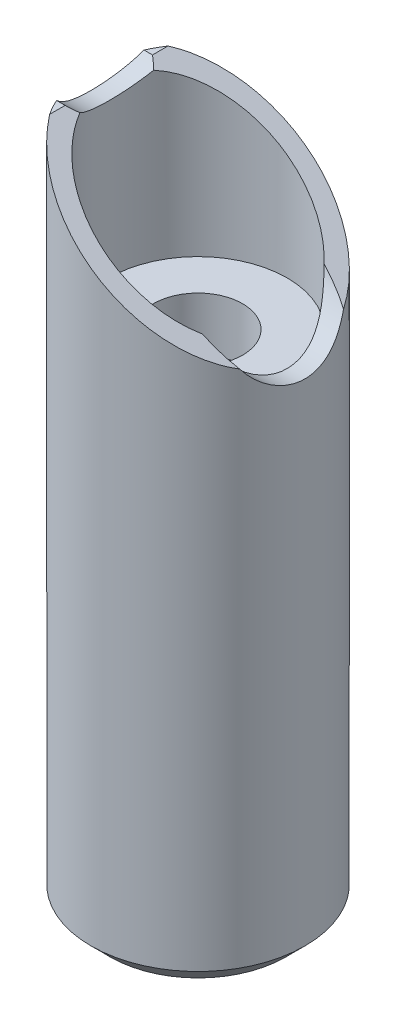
ISO-10303-21;
HEADER;
FILE_DESCRIPTION(('STEP AP214'),'2;1');
FILE_NAME('part.step','',(''),(''),'','','');
FILE_SCHEMA(('AUTOMOTIVE_DESIGN { 1 0 10303 214 1 1 1 1 }'));
ENDSEC;
DATA;
#1=APPLICATION_CONTEXT('core data for automotive mechanical design processes');
#2=APPLICATION_PROTOCOL_DEFINITION('international standard','automotive_design',2000,#1);
#3=PRODUCT_CONTEXT('',#1,'mechanical');
#4=PRODUCT('Part','Part','',(#3));
#5=PRODUCT_RELATED_PRODUCT_CATEGORY('part','',(#4));
#6=PRODUCT_DEFINITION_FORMATION('','',#4);
#7=PRODUCT_DEFINITION_CONTEXT('part definition',#1,'design');
#8=PRODUCT_DEFINITION('design','',#6,#7);
#9=PRODUCT_DEFINITION_SHAPE('','',#8);
#10=(LENGTH_UNIT() NAMED_UNIT(*) SI_UNIT(.MILLI.,.METRE.));
#11=(NAMED_UNIT(*) PLANE_ANGLE_UNIT() SI_UNIT($,.RADIAN.));
#12=(NAMED_UNIT(*) SI_UNIT($,.STERADIAN.) SOLID_ANGLE_UNIT());
#13=UNCERTAINTY_MEASURE_WITH_UNIT(LENGTH_MEASURE(1.E-05),#10,'distance_accuracy_value','');
#14=(GEOMETRIC_REPRESENTATION_CONTEXT(3) GLOBAL_UNCERTAINTY_ASSIGNED_CONTEXT((#13)) GLOBAL_UNIT_ASSIGNED_CONTEXT((#10,
#11,#12)) REPRESENTATION_CONTEXT('',''));
#15=CARTESIAN_POINT('',(0.,0.,0.));
#16=DIRECTION('',(0.,0.,1.));
#17=DIRECTION('',(1.,0.,0.));
#18=AXIS2_PLACEMENT_3D('',#15,#16,#17);
#19=CARTESIAN_POINT('',(-5.47722557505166,37.6,-2.44948974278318));
#20=DIRECTION('',(0.,1.,0.));
#21=DIRECTION('',(1.,0.,0.));
#22=AXIS2_PLACEMENT_3D('',#19,#20,#21);
#23=PLANE('',#22);
#24=CARTESIAN_POINT('',(0.,37.6,0.));
#25=DIRECTION('',(0.,1.,0.));
#26=DIRECTION('',(-0.833333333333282,0.,-0.552770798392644));
#27=AXIS2_PLACEMENT_3D('',#24,#25,#26);
#28=CIRCLE('',#27,6.);
#29=CARTESIAN_POINT('',(-5.47722557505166,37.6,-2.44948974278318));
#30=VERTEX_POINT('',#29);
#31=CARTESIAN_POINT('',(-4.99999999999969,37.6,-3.31662479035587));
#32=VERTEX_POINT('',#31);
#33=EDGE_CURVE('E88',#30,#32,#28,.F.);
#34=ORIENTED_EDGE('',*,*,#33,.F.);
#35=DIRECTION('',(1.,0.,-4.14290568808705E-08));
#36=VECTOR('',#35,1.);
#37=CARTESIAN_POINT('',(-5.47722557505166,37.6,-2.44948974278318));
#38=LINE('',#37,#36);
#39=CARTESIAN_POINT('',(-5.00000002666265,37.6,-2.44948976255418));
#40=VERTEX_POINT('',#39);
#41=EDGE_CURVE('E102',#30,#40,#38,.T.);
#42=ORIENTED_EDGE('',*,*,#41,.T.);
#43=DIRECTION('',(3.0748217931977E-08,0.,-1.));
#44=VECTOR('',#43,1.);
#45=CARTESIAN_POINT('',(-5.00000002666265,37.6,-2.44948976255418));
#46=LINE('',#45,#44);
#47=EDGE_CURVE('E104',#40,#32,#46,.T.);
#48=ORIENTED_EDGE('',*,*,#47,.T.);
#49=EDGE_LOOP('',(#34,#42,#48));
#50=FACE_BOUND('',#49,.T.);
#51=ADVANCED_FACE('F14',(#50),#23,.T.);
#52=CARTESIAN_POINT('',(5.24720270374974,30.1549714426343,-6.));
#53=DIRECTION('',(0.587785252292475,0.809016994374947,0.));
#54=DIRECTION('',(-0.809016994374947,0.587785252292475,0.));
#55=AXIS2_PLACEMENT_3D('',#52,#53,#54);
#56=PLANE('',#55);
#57=CARTESIAN_POINT('',(-4.55296105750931,37.2752071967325,-2.06652984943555));
#58=CARTESIAN_POINT('',(-4.57006689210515,37.2876353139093,-2.08351803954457));
#59=CARTESIAN_POINT('',(-4.58729948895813,37.3001555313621,-2.10031077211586));
#60=CARTESIAN_POINT('',(-4.62217033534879,37.3254906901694,-2.13366844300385));
#61=CARTESIAN_POINT('',(-4.63981088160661,37.3383073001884,-2.15022971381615));
#62=CARTESIAN_POINT('',(-4.67549304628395,37.3642319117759,-2.18312059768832));
#63=CARTESIAN_POINT('',(-4.69353688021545,37.3773415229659,-2.19944653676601));
#64=CARTESIAN_POINT('',(-4.73002123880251,37.4038489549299,-2.23186290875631));
#65=CARTESIAN_POINT('',(-4.7484638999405,37.4172483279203,-2.24794966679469));
#66=CARTESIAN_POINT('',(-4.78574147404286,37.4443320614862,-2.27988382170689));
#67=CARTESIAN_POINT('',(-4.80457844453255,37.4580179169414,-2.29572754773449));
#68=CARTESIAN_POINT('',(-4.8426402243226,37.4856714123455,-2.32717177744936));
#69=CARTESIAN_POINT('',(-4.86186701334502,37.4996404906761,-2.34276861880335));
#70=CARTESIAN_POINT('',(-4.90070396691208,37.5278571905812,-2.37371521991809));
#71=CARTESIAN_POINT('',(-4.92031603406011,37.5421061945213,-2.38906133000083));
#72=CARTESIAN_POINT('',(-4.95991925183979,37.5708796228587,-2.41950256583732));
#73=CARTESIAN_POINT('',(-4.97991223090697,37.5854053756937,-2.43459405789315));
#74=CARTESIAN_POINT('',(-5.00000002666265,37.6000000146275,-2.4494897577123));
#75=B_SPLINE_CURVE_WITH_KNOTS('',3,(#57,#58,#59,#60,#61,#62,#63,#64,#65,#66,#67,#68,#69,#70,#71,
#72,#73,#74),.UNSPECIFIED.,.F.,.F.,(4,2,2,2,2,2,2,2,4),(0.,0.0813679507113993,0.163507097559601,
0.246423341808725,0.330121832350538,0.414606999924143,0.499882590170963,0.585951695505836,
0.67281678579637),.UNSPECIFIED.);
#76=CARTESIAN_POINT('',(-4.55296105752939,37.2752071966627,-2.06652984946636));
#77=VERTEX_POINT('',#76);
#78=EDGE_CURVE('E108',#77,#40,#75,.T.);
#79=ORIENTED_EDGE('',*,*,#78,.F.);
#80=CARTESIAN_POINT('',(-4.55296105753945,37.2752071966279,-2.06652984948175));
#81=CARTESIAN_POINT('',(-4.22372450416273,37.0360028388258,-2.79190103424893));
#82=CARTESIAN_POINT('',(-3.72627010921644,36.6745810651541,-3.42894652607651));
#83=CARTESIAN_POINT('',(-2.78357702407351,35.9896744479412,-4.17263726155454));
#84=CARTESIAN_POINT('',(-2.45071777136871,35.7478380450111,-4.37522577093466));
#85=CARTESIAN_POINT('',(-1.7801294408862,35.2606271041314,-4.68574063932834));
#86=CARTESIAN_POINT('',(-1.44319744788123,35.0158316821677,-4.80137432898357));
#87=CARTESIAN_POINT('',(-0.741287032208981,34.5058639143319,-4.9585040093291));
#88=CARTESIAN_POINT('',(-0.376308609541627,34.2406915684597,-5.00000000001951));
#89=CARTESIAN_POINT('',(0.,33.9672873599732,-5.));
#90=B_SPLINE_CURVE_WITH_KNOTS('',3,(#80,#81,#82,#83,#84,#85,#86,#87,#88,#89),.UNSPECIFIED.,.F.,
.F.,(4,2,2,2,4),(0.,0.415391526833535,0.622123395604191,0.811061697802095,1.),.UNSPECIFIED.);
#91=CARTESIAN_POINT('',(0.,33.9672873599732,-5.));
#92=VERTEX_POINT('',#91);
#93=EDGE_CURVE('E177',#77,#92,#90,.T.);
#94=ORIENTED_EDGE('',*,*,#93,.T.);
#95=CARTESIAN_POINT('',(0.,33.9672873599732,-5.));
#96=CARTESIAN_POINT('',(0.350725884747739,33.7124700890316,-5.00000000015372));
#97=CARTESIAN_POINT('',(0.69446346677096,33.462730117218,-4.96359602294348));
#98=CARTESIAN_POINT('',(1.36131180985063,32.9782364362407,-4.82350089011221));
#99=CARTESIAN_POINT('',(1.6844225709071,32.743482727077,-4.71980973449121));
#100=CARTESIAN_POINT('',(2.42745993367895,32.2036344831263,-4.39669909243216));
#101=CARTESIAN_POINT('',(2.83244048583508,31.9093988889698,-4.14776792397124));
#102=CARTESIAN_POINT('',(3.35798245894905,31.5275702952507,-3.71053768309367));
#103=CARTESIAN_POINT('',(3.51101312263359,31.416387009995,-3.56631575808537));
#104=CARTESIAN_POINT('',(3.65699081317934,31.3103280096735,-3.40975338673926));
#105=B_SPLINE_CURVE_WITH_KNOTS('',3,(#95,#96,#97,#98,#99,#100,#101,#102,#103,#104),
.UNSPECIFIED.,.F.,.F.,(4,2,2,2,4),(0.,0.249259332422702,0.498518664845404,0.847726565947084,1.),.UNSPECIFIED.);
#106=CARTESIAN_POINT('',(3.65699081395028,31.3103280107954,-3.40975338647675));
#107=VERTEX_POINT('',#106);
#108=EDGE_CURVE('E171',#92,#107,#105,.T.);
#109=ORIENTED_EDGE('',*,*,#108,.T.);
#110=CARTESIAN_POINT('',(3.65699081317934,31.3103280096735,-3.40975338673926));
#111=CARTESIAN_POINT('',(4.22429611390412,30.898156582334,-3.31429772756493));
#112=CARTESIAN_POINT('',(4.76308031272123,30.5067069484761,-3.14490290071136));
#113=CARTESIAN_POINT('',(5.24720270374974,30.1549714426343,-2.90978759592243));
#114=B_SPLINE_CURVE_WITH_KNOTS('',3,(#110,#111,#112,#113),.UNSPECIFIED.,.F.,.F.,(4,4),(0.,1.),.UNSPECIFIED.);
#115=CARTESIAN_POINT('',(5.24720270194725,30.154971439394,-2.90978759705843));
#116=VERTEX_POINT('',#115);
#117=EDGE_CURVE('E168',#107,#116,#114,.T.);
#118=ORIENTED_EDGE('',*,*,#117,.T.);
#119=CARTESIAN_POINT('',(5.24720270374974,30.1549714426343,-2.90978759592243));
#120=CARTESIAN_POINT('',(4.85893514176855,30.4370643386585,-3.60994814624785));
#121=CARTESIAN_POINT('',(4.33724979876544,30.8160909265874,-4.22066484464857));
#122=CARTESIAN_POINT('',(3.35828918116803,31.5273474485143,-4.99296702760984));
#123=CARTESIAN_POINT('',(2.98026669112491,31.8019968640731,-5.22594412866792));
#124=CARTESIAN_POINT('',(1.92965139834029,32.5653135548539,-5.72736077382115));
#125=CARTESIAN_POINT('',(1.21330239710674,33.0857715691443,-5.92671368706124));
#126=CARTESIAN_POINT('',(0.296423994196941,33.7519227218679,-5.99456200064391));
#127=CARTESIAN_POINT('',(0.148411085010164,33.8594603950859,-5.99999998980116));
#128=CARTESIAN_POINT('',(3.10896843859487E-07,33.9672871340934,-6.));
#129=B_SPLINE_CURVE_WITH_KNOTS('',3,(#119,#120,#121,#122,#123,#124,#125,#126,#127,#128),
.UNSPECIFIED.,.F.,.F.,(4,2,2,2,4),(0.,0.368728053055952,0.581227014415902,0.932580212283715,1.),.UNSPECIFIED.);
#130=CARTESIAN_POINT('',(2.76367589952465E-07,33.9672870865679,-6.));
#131=VERTEX_POINT('',#130);
#132=EDGE_CURVE('E169',#116,#131,#129,.T.);
#133=ORIENTED_EDGE('',*,*,#132,.T.);
#134=CARTESIAN_POINT('',(3.10896843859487E-07,33.9672871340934,-6.));
#135=CARTESIAN_POINT('',(-0.445232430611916,34.2907676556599,-5.99999999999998));
#136=CARTESIAN_POINT('',(-0.886884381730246,34.6116465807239,-5.95105810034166));
#137=CARTESIAN_POINT('',(-1.82634881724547,35.2942074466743,-5.73836458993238));
#138=CARTESIAN_POINT('',(-2.30895893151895,35.6448442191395,-5.56213529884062));
#139=CARTESIAN_POINT('',(-3.44165568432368,36.4677965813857,-4.97305445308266));
#140=CARTESIAN_POINT('',(-4.02881259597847,36.8943910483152,-4.50605616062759));
#141=CARTESIAN_POINT('',(-4.68881915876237,37.3739138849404,-3.75341582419));
#142=CARTESIAN_POINT('',(-4.85211752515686,37.4925570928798,-3.53956597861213));
#143=CARTESIAN_POINT('',(-4.99999999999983,37.5999999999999,-3.31662479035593));
#144=B_SPLINE_CURVE_WITH_KNOTS('',3,(#134,#135,#136,#137,#138,#139,#140,#141,#142,#143),
.UNSPECIFIED.,.F.,.F.,(4,2,2,2,4),(0.,0.225549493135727,0.483804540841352,0.860098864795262,1.),.UNSPECIFIED.);
#145=EDGE_CURVE('E176',#131,#32,#144,.T.);
#146=ORIENTED_EDGE('',*,*,#145,.T.);
#147=ORIENTED_EDGE('',*,*,#47,.F.);
#148=EDGE_LOOP('',(#79,#94,#109,#118,#133,#146,#147));
#149=FACE_BOUND('',#148,.T.);
#150=ADVANCED_FACE('F126',(#149),#56,.T.);
#151=CARTESIAN_POINT('',(-5.47722557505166,37.6,3.31662725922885));
#152=DIRECTION('',(0.,1.,0.));
#153=DIRECTION('',(1.,0.,0.));
#154=AXIS2_PLACEMENT_3D('',#151,#152,#153);
#155=PLANE('',#154);
#156=DIRECTION('',(-1.91933647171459E-06,0.,-0.999999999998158));
#157=VECTOR('',#156,1.);
#158=CARTESIAN_POINT('',(-4.9999983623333,37.6,3.31662725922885));
#159=LINE('',#158,#157);
#160=CARTESIAN_POINT('',(-4.9999983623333,37.6,3.31662725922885));
#161=VERTEX_POINT('',#160);
#162=CARTESIAN_POINT('',(-5.00000002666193,37.6,2.44948976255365));
#163=VERTEX_POINT('',#162);
#164=EDGE_CURVE('E331',#161,#163,#159,.T.);
#165=ORIENTED_EDGE('',*,*,#164,.T.);
#166=DIRECTION('',(-1.,0.,-4.14279383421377E-08));
#167=VECTOR('',#166,1.);
#168=CARTESIAN_POINT('',(-5.00000002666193,37.6,2.44948976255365));
#169=LINE('',#168,#167);
#170=CARTESIAN_POINT('',(-5.47722557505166,37.6,2.44948974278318));
#171=VERTEX_POINT('',#170);
#172=EDGE_CURVE('E284',#163,#171,#169,.T.);
#173=ORIENTED_EDGE('',*,*,#172,.T.);
#174=CARTESIAN_POINT('',(0.,37.6,0.));
#175=DIRECTION('',(0.,1.,0.));
#176=DIRECTION('',(-0.912870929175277,0.,0.408248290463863));
#177=AXIS2_PLACEMENT_3D('',#174,#175,#176);
#178=CIRCLE('',#177,6.);
#179=EDGE_CURVE('E91',#161,#171,#178,.F.);
#180=ORIENTED_EDGE('',*,*,#179,.F.);
#181=EDGE_LOOP('',(#165,#173,#180));
#182=FACE_BOUND('',#181,.T.);
#183=ADVANCED_FACE('F136',(#182),#155,.T.);
#184=CARTESIAN_POINT('',(-4.9265,0.,-4.9265));
#185=DIRECTION('',(0.,-1.,0.));
#186=DIRECTION('',(1.,0.,0.));
#187=AXIS2_PLACEMENT_3D('',#184,#185,#186);
#188=PLANE('',#187);
#189=CARTESIAN_POINT('',(0.,0.,0.));
#190=DIRECTION('',(0.,-1.,0.));
#191=DIRECTION('',(0.,0.,1.));
#192=AXIS2_PLACEMENT_3D('',#189,#190,#191);
#193=CIRCLE('',#192,4.9265);
#194=CARTESIAN_POINT('',(0.,0.,4.9265));
#195=VERTEX_POINT('',#194);
#196=EDGE_CURVE('E332',#195,#195,#193,.T.);
#197=ORIENTED_EDGE('',*,*,#196,.T.);
#198=EDGE_LOOP('',(#197));
#199=FACE_BOUND('',#198,.T.);
#200=CARTESIAN_POINT('',(0.,0.,0.));
#201=DIRECTION('',(0.,1.,0.));
#202=DIRECTION('',(0.,0.,-1.));
#203=AXIS2_PLACEMENT_3D('',#200,#201,#202);
#204=CIRCLE('',#203,4.);
#205=CARTESIAN_POINT('',(0.,0.,-4.));
#206=VERTEX_POINT('',#205);
#207=EDGE_CURVE('E286',#206,#206,#204,.F.);
#208=ORIENTED_EDGE('',*,*,#207,.F.);
#209=EDGE_LOOP('',(#208));
#210=FACE_BOUND('',#209,.T.);
#211=ADVANCED_FACE('F252',(#199,#210),#188,.T.);
#212=CARTESIAN_POINT('',(5.24720278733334,30.1549713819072,2.06652984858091));
#213=DIRECTION('',(0.587785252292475,0.809016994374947,0.));
#214=DIRECTION('',(-0.809016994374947,0.587785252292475,0.));
#215=AXIS2_PLACEMENT_3D('',#212,#213,#214);
#216=PLANE('',#215);
#217=CARTESIAN_POINT('',(-5.00000002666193,37.6000000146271,2.4494897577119));
#218=CARTESIAN_POINT('',(-4.97991223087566,37.5854053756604,2.43459405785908));
#219=CARTESIAN_POINT('',(-4.95991925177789,37.570879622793,2.41950256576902));
#220=CARTESIAN_POINT('',(-4.92031603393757,37.5421061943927,2.38906132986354));
#221=CARTESIAN_POINT('',(-4.9007039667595,37.5278571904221,2.37371521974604));
#222=CARTESIAN_POINT('',(-4.86186701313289,37.4996404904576,2.3427686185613));
#223=CARTESIAN_POINT('',(-4.84264022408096,37.4856714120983,2.32717177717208));
#224=CARTESIAN_POINT('',(-4.80457844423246,37.4580179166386,2.29572754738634));
#225=CARTESIAN_POINT('',(-4.78574147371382,37.4443320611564,2.27988382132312));
#226=CARTESIAN_POINT('',(-4.74846389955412,37.4172483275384,2.24794966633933));
#227=CARTESIAN_POINT('',(-4.73002123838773,37.4038489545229,2.23186290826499));
#228=CARTESIAN_POINT('',(-4.69353687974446,37.3773415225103,2.1994465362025));
#229=CARTESIAN_POINT('',(-4.67549304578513,37.364231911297,2.1831205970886));
#230=CARTESIAN_POINT('',(-4.6398108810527,37.3383072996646,2.1502297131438));
#231=CARTESIAN_POINT('',(-4.62217033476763,37.325490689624,2.13366844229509));
#232=CARTESIAN_POINT('',(-4.58729948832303,37.3001555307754,2.10031077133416));
#233=CARTESIAN_POINT('',(-4.57006689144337,37.2876353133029,2.08351803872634));
#234=CARTESIAN_POINT('',(-4.55296105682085,37.2752071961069,2.06652984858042));
#235=B_SPLINE_CURVE_WITH_KNOTS('',3,(#217,#218,#219,#220,#221,#222,#223,#224,#225,#226,#227,
#228,#229,#230,#231,#232,#233,#234),.UNSPECIFIED.,.F.,.F.,(4,2,2,2,2,2,2,2,4),(0.,
0.0868650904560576,0.172934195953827,0.258209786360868,0.342694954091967,0.426393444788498,
0.509309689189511,0.591448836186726,0.672816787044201),.UNSPECIFIED.);
#236=CARTESIAN_POINT('',(-4.552961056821,37.2752071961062,2.06652984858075));
#237=VERTEX_POINT('',#236);
#238=EDGE_CURVE('E279',#163,#237,#235,.T.);
#239=ORIENTED_EDGE('',*,*,#238,.F.);
#240=ORIENTED_EDGE('',*,*,#164,.F.);
#241=CARTESIAN_POINT('',(-4.99999892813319,37.5999992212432,3.31662725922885));
#242=CARTESIAN_POINT('',(-4.6430175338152,37.3406370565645,3.85479607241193));
#243=CARTESIAN_POINT('',(-4.20855316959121,37.024980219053,4.32219380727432));
#244=CARTESIAN_POINT('',(-3.22931286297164,36.3135204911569,5.09471638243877));
#245=CARTESIAN_POINT('',(-2.68501620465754,35.9180658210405,5.40379668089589));
#246=CARTESIAN_POINT('',(-1.4185933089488,34.9979557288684,5.87321515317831));
#247=CARTESIAN_POINT('',(-0.71209218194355,34.4846526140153,5.9999997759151));
#248=CARTESIAN_POINT('',(-1.13101334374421E-06,33.9672881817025,5.99999999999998));
#249=B_SPLINE_CURVE_WITH_KNOTS('',3,(#241,#242,#243,#244,#245,#246,#247,#248),.UNSPECIFIED.,.F.,
.F.,(4,2,2,4),(0.,0.324050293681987,0.644504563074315,1.),.UNSPECIFIED.);
#250=CARTESIAN_POINT('',(-1.00240102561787E-06,33.9672883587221,6.));
#251=VERTEX_POINT('',#250);
#252=EDGE_CURVE('E285',#161,#251,#249,.T.);
#253=ORIENTED_EDGE('',*,*,#252,.T.);
#254=CARTESIAN_POINT('',(-1.13101334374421E-06,33.9672881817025,5.99999999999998));
#255=CARTESIAN_POINT('',(0.44523164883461,33.6438076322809,5.99999994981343));
#256=CARTESIAN_POINT('',(0.886883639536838,33.3229286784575,5.95105799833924));
#257=CARTESIAN_POINT('',(1.82634840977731,32.640367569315,5.73836431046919));
#258=CARTESIAN_POINT('',(2.30895877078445,32.2897306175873,5.56213483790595));
#259=CARTESIAN_POINT('',(3.44165578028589,31.46677806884,4.97305357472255));
#260=CARTESIAN_POINT('',(4.02881277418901,31.0401835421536,4.5060550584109));
#261=CARTESIAN_POINT('',(4.79127747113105,30.4862205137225,3.63657607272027));
#262=CARTESIAN_POINT('',(5.03789907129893,30.3070394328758,3.28722249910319));
#263=CARTESIAN_POINT('',(5.24720278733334,30.1549713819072,2.90978645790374));
#264=B_SPLINE_CURVE_WITH_KNOTS('',3,(#254,#255,#256,#257,#258,#259,#260,#261,#262,#263),
.UNSPECIFIED.,.F.,.F.,(4,2,2,2,4),(0.,0.208816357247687,0.447912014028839,0.796289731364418,1.),.UNSPECIFIED.);
#265=CARTESIAN_POINT('',(5.24720287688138,30.1549712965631,2.90978676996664));
#266=VERTEX_POINT('',#265);
#267=EDGE_CURVE('E233',#251,#266,#264,.T.);
#268=ORIENTED_EDGE('',*,*,#267,.T.);
#269=CARTESIAN_POINT('',(5.24720278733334,30.1549713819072,2.90978645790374));
#270=CARTESIAN_POINT('',(4.7630803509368,30.5067069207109,3.14490217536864));
#271=CARTESIAN_POINT('',(4.22429612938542,30.8981565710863,3.31429737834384));
#272=CARTESIAN_POINT('',(3.65699082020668,31.3103280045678,3.40975338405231));
#273=B_SPLINE_CURVE_WITH_KNOTS('',3,(#269,#270,#271,#272),.UNSPECIFIED.,.F.,.F.,(4,4),(0.,1.),.UNSPECIFIED.);
#274=CARTESIAN_POINT('',(3.65699082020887,31.3103280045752,3.40975338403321));
#275=VERTEX_POINT('',#274);
#276=EDGE_CURVE('E220',#266,#275,#273,.T.);
#277=ORIENTED_EDGE('',*,*,#276,.T.);
#278=CARTESIAN_POINT('',(3.65699082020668,31.3103280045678,3.40975338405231));
#279=CARTESIAN_POINT('',(3.41811823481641,31.4838790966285,3.66594635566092));
#280=CARTESIAN_POINT('',(3.16036000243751,31.6711514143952,3.88909548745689));
#281=CARTESIAN_POINT('',(2.43333294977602,32.1993674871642,4.40296071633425));
#282=CARTESIAN_POINT('',(1.92300311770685,32.5701438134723,4.65401357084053));
#283=CARTESIAN_POINT('',(0.908805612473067,33.3070014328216,4.93782490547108));
#284=CARTESIAN_POINT('',(0.456266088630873,33.6357906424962,4.99999999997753));
#285=CARTESIAN_POINT('',(0.,33.9672873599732,5.));
#286=B_SPLINE_CURVE_WITH_KNOTS('',3,(#278,#279,#280,#281,#282,#283,#284,#285),.UNSPECIFIED.,.F.,
.F.,(4,2,2,4),(0.,0.25574178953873,0.677506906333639,1.),.UNSPECIFIED.);
#287=CARTESIAN_POINT('',(0.,33.9672873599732,5.));
#288=VERTEX_POINT('',#287);
#289=EDGE_CURVE('E40',#275,#288,#286,.T.);
#290=ORIENTED_EDGE('',*,*,#289,.T.);
#291=CARTESIAN_POINT('',(0.,33.9672873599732,5.));
#292=CARTESIAN_POINT('',(-0.371027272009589,34.236854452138,5.00000000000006));
#293=CARTESIAN_POINT('',(-0.739070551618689,34.5042535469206,4.95921508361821));
#294=CARTESIAN_POINT('',(-1.52195747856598,35.0730541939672,4.78197050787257));
#295=CARTESIAN_POINT('',(-1.92413249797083,35.3652514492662,4.63511279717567));
#296=CARTESIAN_POINT('',(-2.93987675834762,36.1032328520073,4.10685537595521));
#297=CARTESIAN_POINT('',(-3.46662837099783,36.4859403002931,3.66464067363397));
#298=CARTESIAN_POINT('',(-4.14816334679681,36.9811044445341,2.82221711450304));
#299=CARTESIAN_POINT('',(-4.37219842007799,37.1438754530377,2.46478452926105));
#300=CARTESIAN_POINT('',(-4.55296105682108,37.275207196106,2.06652984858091));
#301=B_SPLINE_CURVE_WITH_KNOTS('',3,(#291,#292,#293,#294,#295,#296,#297,#298,#299,#300),
.UNSPECIFIED.,.F.,.F.,(4,2,2,2,4),(0.,0.192471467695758,0.412852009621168,0.775167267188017,1.),.UNSPECIFIED.);
#302=EDGE_CURVE('E219',#288,#237,#301,.T.);
#303=ORIENTED_EDGE('',*,*,#302,.T.);
#304=EDGE_LOOP('',(#239,#240,#253,#268,#277,#290,#303));
#305=FACE_BOUND('',#304,.T.);
#306=ADVANCED_FACE('F231',(#305),#216,.T.);
#307=CARTESIAN_POINT('',(-5.,28.,-5.));
#308=DIRECTION('',(0.,1.,0.));
#309=DIRECTION('',(0.,0.,1.));
#310=AXIS2_PLACEMENT_3D('',#307,#308,#309);
#311=PLANE('',#310);
#312=CARTESIAN_POINT('',(0.,28.,0.));
#313=DIRECTION('',(0.,1.,0.));
#314=DIRECTION('',(0.,0.,-1.));
#315=AXIS2_PLACEMENT_3D('',#312,#313,#314);
#316=CIRCLE('',#315,5.);
#317=CARTESIAN_POINT('',(0.,28.,-5.));
#318=VERTEX_POINT('',#317);
#319=EDGE_CURVE('E281',#318,#318,#316,.F.);
#320=ORIENTED_EDGE('',*,*,#319,.F.);
#321=EDGE_LOOP('',(#320));
#322=FACE_BOUND('',#321,.T.);
#323=CARTESIAN_POINT('',(0.,28.,0.));
#324=DIRECTION('',(0.,-1.,0.));
#325=DIRECTION('',(-1.42053901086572E-07,0.,1.));
#326=AXIS2_PLACEMENT_3D('',#323,#324,#325);
#327=CIRCLE('',#326,2.5);
#328=CARTESIAN_POINT('',(-3.55134752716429E-07,28.,2.5));
#329=VERTEX_POINT('',#328);
#330=EDGE_CURVE('E463',#329,#329,#327,.T.);
#331=ORIENTED_EDGE('',*,*,#330,.T.);
#332=EDGE_LOOP('',(#331));
#333=FACE_BOUND('',#332,.T.);
#334=ADVANCED_FACE('F251',(#322,#333),#311,.T.);
#335=CARTESIAN_POINT('',(-4.,25.,4.));
#336=DIRECTION('',(0.,-1.,0.));
#337=DIRECTION('',(0.,0.,-1.));
#338=AXIS2_PLACEMENT_3D('',#335,#336,#337);
#339=PLANE('',#338);
#340=CARTESIAN_POINT('',(0.,25.,0.));
#341=DIRECTION('',(0.,-1.,0.));
#342=DIRECTION('',(0.,0.,1.));
#343=AXIS2_PLACEMENT_3D('',#340,#341,#342);
#344=CIRCLE('',#343,4.);
#345=CARTESIAN_POINT('',(0.,25.,4.));
#346=VERTEX_POINT('',#345);
#347=EDGE_CURVE('E465',#346,#346,#344,.T.);
#348=ORIENTED_EDGE('',*,*,#347,.T.);
#349=EDGE_LOOP('',(#348));
#350=FACE_BOUND('',#349,.T.);
#351=CARTESIAN_POINT('',(0.,25.,0.));
#352=DIRECTION('',(0.,1.,0.));
#353=DIRECTION('',(0.,0.,-1.));
#354=AXIS2_PLACEMENT_3D('',#351,#352,#353);
#355=CIRCLE('',#354,2.5);
#356=CARTESIAN_POINT('',(0.,25.,-2.5));
#357=VERTEX_POINT('',#356);
#358=EDGE_CURVE('E460',#357,#357,#355,.F.);
#359=ORIENTED_EDGE('',*,*,#358,.F.);
#360=EDGE_LOOP('',(#359));
#361=FACE_BOUND('',#360,.T.);
#362=ADVANCED_FACE('F394',(#350,#361),#339,.T.);
#363=CARTESIAN_POINT('',(7.,32.1,0.));
#364=DIRECTION('',(-1.,0.,0.));
#365=DIRECTION('',(0.,-0.225620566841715,-0.974215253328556));
#366=AXIS2_PLACEMENT_3D('',#363,#364,#365);
#367=CYLINDRICAL_SURFACE('',#366,3.5);
#368=CARTESIAN_POINT('',(5.24720305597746,30.1549711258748,2.90978739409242));
#369=CARTESIAN_POINT('',(5.25894624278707,30.1232902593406,2.8886104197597));
#370=CARTESIAN_POINT('',(5.27079363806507,30.0919821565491,2.86693423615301));
#371=CARTESIAN_POINT('',(5.2946167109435,30.0302205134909,2.82266759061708));
#372=CARTESIAN_POINT('',(5.30659191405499,29.9997647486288,2.80007997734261));
#373=CARTESIAN_POINT('',(5.33063302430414,29.9396979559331,2.75400158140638));
#374=CARTESIAN_POINT('',(5.34269867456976,29.910085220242,2.7305128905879));
#375=CARTESIAN_POINT('',(5.36688287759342,29.8516963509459,2.68263935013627));
#376=CARTESIAN_POINT('',(5.37900132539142,29.8229190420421,2.6582558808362));
#377=CARTESIAN_POINT('',(5.40325346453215,29.7661951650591,2.60859632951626));
#378=CARTESIAN_POINT('',(5.4153871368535,29.7382479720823,2.58332095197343));
#379=CARTESIAN_POINT('',(5.43963211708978,29.6831809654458,2.53187783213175));
#380=CARTESIAN_POINT('',(5.45174342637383,29.6560610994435,2.50571014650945));
#381=CARTESIAN_POINT('',(5.47590612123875,29.6026481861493,2.4524796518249));
#382=CARTESIAN_POINT('',(5.48795746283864,29.5763556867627,2.42541627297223));
#383=CARTESIAN_POINT('',(5.51196281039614,29.5246000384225,2.37038892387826));
#384=CARTESIAN_POINT('',(5.52391666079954,29.4991380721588,2.34242377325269));
#385=CARTESIAN_POINT('',(5.54768936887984,29.449049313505,2.28558489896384));
#386=CARTESIAN_POINT('',(5.55950789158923,29.4244243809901,2.25670939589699));
#387=CARTESIAN_POINT('',(5.58297352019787,29.3760193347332,2.19803997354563));
#388=CARTESIAN_POINT('',(5.59462004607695,29.3522418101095,2.16824368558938));
#389=CARTESIAN_POINT('',(5.6176788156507,29.3055890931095,2.10777802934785));
#390=CARTESIAN_POINT('',(5.6290906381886,29.2827154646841,2.07710729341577));
#391=CARTESIAN_POINT('',(5.65161400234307,29.2379455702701,2.01497150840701));
#392=CARTESIAN_POINT('',(5.66272565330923,29.216048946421,1.98350675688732));
#393=CARTESIAN_POINT('',(5.68461309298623,29.1732581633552,1.91980569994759));
#394=CARTESIAN_POINT('',(5.69538899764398,29.1523636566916,1.8875696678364));
#395=CARTESIAN_POINT('',(5.7165680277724,29.1116019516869,1.82234888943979));
#396=CARTESIAN_POINT('',(5.72697126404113,29.0917344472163,1.78936437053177));
#397=CARTESIAN_POINT('',(5.74736768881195,29.0530517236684,1.72267000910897));
#398=CARTESIAN_POINT('',(5.75736096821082,29.0342362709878,1.68896032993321));
#399=CARTESIAN_POINT('',(5.77690307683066,28.9976830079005,1.62084030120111));
#400=CARTESIAN_POINT('',(5.78645195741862,28.9799450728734,1.58643003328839));
#401=CARTESIAN_POINT('',(5.80505984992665,28.9455713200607,1.5169319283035));
#402=CARTESIAN_POINT('',(5.81411885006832,28.9289355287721,1.48184407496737));
#403=CARTESIAN_POINT('',(5.83176340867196,28.8967570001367,1.4109407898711));
#404=CARTESIAN_POINT('',(5.84034771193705,28.8812171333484,1.37512374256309));
#405=CARTESIAN_POINT('',(5.8570487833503,28.8511614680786,1.30253821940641));
#406=CARTESIAN_POINT('',(5.86516034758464,28.8366567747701,1.26576394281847));
#407=CARTESIAN_POINT('',(5.88087309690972,28.8086373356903,1.19102890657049));
#408=CARTESIAN_POINT('',(5.88846395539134,28.7951423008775,1.15305857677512));
#409=CARTESIAN_POINT('',(5.90310653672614,28.7691453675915,1.07569055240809));
#410=CARTESIAN_POINT('',(5.91014223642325,28.7566727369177,1.03627998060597));
#411=CARTESIAN_POINT('',(5.92364085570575,28.7327622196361,0.955783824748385));
#412=CARTESIAN_POINT('',(5.93008154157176,28.7213643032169,0.914682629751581));
#413=CARTESIAN_POINT('',(5.94236559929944,28.6996870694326,0.830555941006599));
#414=CARTESIAN_POINT('',(5.94818077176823,28.6894597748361,0.787512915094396));
#415=CARTESIAN_POINT('',(5.95901762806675,28.6704974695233,0.700376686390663));
#416=CARTESIAN_POINT('',(5.96402742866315,28.6617846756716,0.656277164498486));
#417=CARTESIAN_POINT('',(5.97305144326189,28.6461294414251,0.568121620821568));
#418=CARTESIAN_POINT('',(5.9770750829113,28.6391702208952,0.524069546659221));
#419=CARTESIAN_POINT('',(5.98414030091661,28.6269843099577,0.436027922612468));
#420=CARTESIAN_POINT('',(5.98718985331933,28.6217435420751,0.39204096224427));
#421=CARTESIAN_POINT('',(5.99231149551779,28.6129620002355,0.304143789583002));
#422=CARTESIAN_POINT('',(5.99439008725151,28.609409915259,0.260235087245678));
#423=CARTESIAN_POINT('',(5.99757689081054,28.6039789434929,0.172505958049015));
#424=CARTESIAN_POINT('',(5.99869003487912,28.6020915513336,0.128686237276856));
#425=CARTESIAN_POINT('',(5.9999524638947,28.5999689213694,0.0411442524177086));
#426=CARTESIAN_POINT('',(6.00010506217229,28.5997280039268,-0.00257782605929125));
#427=CARTESIAN_POINT('',(5.99945313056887,28.6008831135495,-0.0899169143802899));
#428=CARTESIAN_POINT('',(5.99865026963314,28.6022762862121,-0.133533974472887));
#429=CARTESIAN_POINT('',(5.9960941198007,28.6066902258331,-0.220656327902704));
#430=CARTESIAN_POINT('',(5.99434086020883,28.6097109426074,-0.264161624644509));
#431=CARTESIAN_POINT('',(5.98989060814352,28.617376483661,-0.351053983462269));
#432=CARTESIAN_POINT('',(5.9871920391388,28.6220240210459,-0.394440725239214));
#433=CARTESIAN_POINT('',(5.9808578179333,28.6329455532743,-0.481089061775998));
#434=CARTESIAN_POINT('',(5.97721904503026,28.6392249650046,-0.524349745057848));
#435=CARTESIAN_POINT('',(5.96901098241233,28.6534183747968,-0.610737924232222));
#436=CARTESIAN_POINT('',(5.96443711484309,28.6613404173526,-0.653863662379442));
#437=CARTESIAN_POINT('',(5.95436537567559,28.6788329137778,-0.73997210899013));
#438=CARTESIAN_POINT('',(5.94886157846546,28.6884139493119,-0.78295197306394));
#439=CARTESIAN_POINT('',(5.93693621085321,28.7092438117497,-0.868756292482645));
#440=CARTESIAN_POINT('',(5.93050749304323,28.7205056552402,-0.91157659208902));
#441=CARTESIAN_POINT('',(5.91673900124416,28.7447219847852,-0.997046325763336));
#442=CARTESIAN_POINT('',(5.90939100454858,28.7576918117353,-1.03969008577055));
#443=CARTESIAN_POINT('',(5.8938100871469,28.7853151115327,-1.12466739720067));
#444=CARTESIAN_POINT('',(5.88557033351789,28.799981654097,-1.16699544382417));
#445=CARTESIAN_POINT('',(5.86840819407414,28.8307182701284,-1.25050258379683));
#446=CARTESIAN_POINT('',(5.85949341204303,28.846772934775,-1.29168891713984));
#447=CARTESIAN_POINT('',(5.84105788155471,28.8801597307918,-1.37278093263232));
#448=CARTESIAN_POINT('',(5.83154599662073,28.8974735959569,-1.41269615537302));
#449=CARTESIAN_POINT('',(5.8119704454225,28.9333108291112,-1.49128269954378));
#450=CARTESIAN_POINT('',(5.80191403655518,28.9518187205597,-1.52996289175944));
#451=CARTESIAN_POINT('',(5.78130228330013,28.9899864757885,-1.60611714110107));
#452=CARTESIAN_POINT('',(5.77075274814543,29.0096333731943,-1.64359927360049));
#453=CARTESIAN_POINT('',(5.74920766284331,29.0500315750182,-1.71739545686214));
#454=CARTESIAN_POINT('',(5.73821662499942,29.0707721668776,-1.75371669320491));
#455=CARTESIAN_POINT('',(5.71584155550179,29.1133197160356,-1.8252286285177));
#456=CARTESIAN_POINT('',(5.70446089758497,29.1351179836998,-1.86042555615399));
#457=CARTESIAN_POINT('',(5.6813581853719,29.1797515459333,-1.9297247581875));
#458=CARTESIAN_POINT('',(5.66963853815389,29.2025799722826,-1.96383226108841));
#459=CARTESIAN_POINT('',(5.6459259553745,29.2492303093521,-2.03095371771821));
#460=CARTESIAN_POINT('',(5.63393494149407,29.2730458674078,-2.06397276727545));
#461=CARTESIAN_POINT('',(5.60978143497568,29.3215032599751,-2.12874958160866));
#462=CARTESIAN_POINT('',(5.59762205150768,29.3461338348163,-2.16051693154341));
#463=CARTESIAN_POINT('',(5.57316778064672,29.3961918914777,-2.22283699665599));
#464=CARTESIAN_POINT('',(5.5608751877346,29.4216098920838,-2.25339823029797));
#465=CARTESIAN_POINT('',(5.53617769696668,29.4732546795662,-2.3133881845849));
#466=CARTESIAN_POINT('',(5.52377412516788,29.4994748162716,-2.34282317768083));
#467=CARTESIAN_POINT('',(5.49887723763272,29.5527484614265,-2.40063493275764));
#468=CARTESIAN_POINT('',(5.48638453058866,29.5797979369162,-2.42901567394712));
#469=CARTESIAN_POINT('',(5.46133178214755,29.6347666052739,-2.48478461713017));
#470=CARTESIAN_POINT('',(5.44877189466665,29.6626842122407,-2.51217445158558));
#471=CARTESIAN_POINT('',(5.42360689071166,29.719436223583,-2.56601779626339));
#472=CARTESIAN_POINT('',(5.41100174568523,29.748271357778,-2.59247052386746));
#473=CARTESIAN_POINT('',(5.38576808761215,29.8069153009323,-2.64448556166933));
#474=CARTESIAN_POINT('',(5.37313963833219,29.8367270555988,-2.67004458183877));
#475=CARTESIAN_POINT('',(5.34788086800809,29.8973899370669,-2.72030689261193));
#476=CARTESIAN_POINT('',(5.33525097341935,29.9282461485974,-2.74500426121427));
#477=CARTESIAN_POINT('',(5.31001087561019,29.9910717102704,-2.79356599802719));
#478=CARTESIAN_POINT('',(5.29740172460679,30.0230482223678,-2.81742164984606));
#479=CARTESIAN_POINT('',(5.27222316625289,30.0881946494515,-2.86430918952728));
#480=CARTESIAN_POINT('',(5.25965566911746,30.1213737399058,-2.8873293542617));
#481=CARTESIAN_POINT('',(5.24720269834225,30.1549714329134,-2.90978759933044));
#482=B_SPLINE_CURVE_WITH_KNOTS('',3,(#368,#369,#370,#371,#372,#373,#374,#375,#376,#377,#378,
#379,#380,#381,#382,#383,#384,#385,#386,#387,#388,#389,#390,#391,#392,#393,#394,#395,#396,#397,
#398,#399,#400,#401,#402,#403,#404,#405,#406,#407,#408,#409,#410,#411,#412,#413,#414,#415,#416,
#417,#418,#419,#420,#421,#422,#423,#424,#425,#426,#427,#428,#429,#430,#431,#432,#433,#434,#435,
#436,#437,#438,#439,#440,#441,#442,#443,#444,#445,#446,#447,#448,#449,#450,#451,#452,#453,#454,
#455,#456,#457,#458,#459,#460,#461,#462,#463,#464,#465,#466,#467,#468,#469,#470,#471,#472,#473,
#474,#475,#476,#477,#478,#479,#480,#481),.UNSPECIFIED.,.F.,.F.,(4,2,2,2,2,2,2,2,2,2,2,2,2,2,2,2,
2,2,2,2,2,2,2,2,2,2,2,2,2,2,2,2,2,2,2,2,2,2,2,2,2,2,2,2,2,2,2,2,2,2,2,2,2,2,2,2,4),(0.,
0.119620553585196,0.238892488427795,0.357902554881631,0.476736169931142,0.595477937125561,
0.714212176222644,0.833023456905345,0.951997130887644,1.07121985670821,1.19078011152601,
1.31053890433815,1.43025346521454,1.54992621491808,1.66956308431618,1.78917328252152,
1.90876962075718,2.02836883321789,2.14827049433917,2.26930886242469,2.39229703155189,
2.51805937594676,2.64743106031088,2.78125687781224,2.91690500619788,3.05120108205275,
3.18436780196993,3.3166295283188,3.44821151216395,3.57933936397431,3.71023850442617,
3.84113360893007,3.9722480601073,4.10380342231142,4.23601895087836,4.3691111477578,
4.50329337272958,4.63877551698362,4.77538114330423,4.91062821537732,5.04420169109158,
5.17629939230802,5.30711130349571,5.43681990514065,5.565600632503,5.69362245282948,
5.82091985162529,5.94688465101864,6.07168403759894,6.19563748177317,6.31906206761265,
6.44227308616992,6.56558468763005,6.68931056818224,6.813764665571,6.93926183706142,
7.06611849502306),.UNSPECIFIED.);
#483=EDGE_CURVE('E225',#266,#116,#482,.T.);
#484=ORIENTED_EDGE('',*,*,#483,.T.);
#485=ORIENTED_EDGE('',*,*,#117,.F.);
#486=CARTESIAN_POINT('',(3.6569908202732,31.3103280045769,3.40975338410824));
#487=CARTESIAN_POINT('',(3.6649848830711,31.2733024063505,3.40117921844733));
#488=CARTESIAN_POINT('',(3.67345512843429,31.2365135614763,3.39203481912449));
#489=CARTESIAN_POINT('',(3.69125829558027,31.1635437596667,3.37265262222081));
#490=CARTESIAN_POINT('',(3.70058891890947,31.1273614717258,3.36241772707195));
#491=CARTESIAN_POINT('',(3.72004797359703,31.0556105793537,3.34087609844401));
#492=CARTESIAN_POINT('',(3.73017494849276,31.0200409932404,3.32957131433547));
#493=CARTESIAN_POINT('',(3.75115965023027,30.9495195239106,3.30591153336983));
#494=CARTESIAN_POINT('',(3.76201654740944,30.9145669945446,3.29355772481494));
#495=CARTESIAN_POINT('',(3.78439360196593,30.8452841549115,3.26782123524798));
#496=CARTESIAN_POINT('',(3.79591336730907,30.8109534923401,3.25443916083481));
#497=CARTESIAN_POINT('',(3.8195480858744,30.7429188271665,3.22666775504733));
#498=CARTESIAN_POINT('',(3.83166292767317,30.7092147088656,3.21227861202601));
#499=CARTESIAN_POINT('',(3.8564194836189,30.6424376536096,3.18251527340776));
#500=CARTESIAN_POINT('',(3.86906124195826,30.6093647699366,3.16714099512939));
#501=CARTESIAN_POINT('',(3.89480334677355,30.543854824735,3.13543043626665));
#502=CARTESIAN_POINT('',(3.90790379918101,30.5114179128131,3.11909393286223));
#503=CARTESIAN_POINT('',(3.93449507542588,30.4471844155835,3.08548340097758));
#504=CARTESIAN_POINT('',(3.94798600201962,30.4153880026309,3.06820912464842));
#505=CARTESIAN_POINT('',(3.97529113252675,30.3524408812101,3.0327481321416));
#506=CARTESIAN_POINT('',(3.98910539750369,30.3212902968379,3.01456124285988));
#507=CARTESIAN_POINT('',(4.01698701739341,30.2596404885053,2.97730693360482));
#508=CARTESIAN_POINT('',(4.03105434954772,30.2291412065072,2.95823959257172));
#509=CARTESIAN_POINT('',(4.05937812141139,30.1688056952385,2.91925157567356));
#510=CARTESIAN_POINT('',(4.07363447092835,30.1389691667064,2.89933129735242));
#511=CARTESIAN_POINT('',(4.10229972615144,30.0799699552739,2.858628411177));
#512=CARTESIAN_POINT('',(4.11670861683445,30.0508072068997,2.83784588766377));
#513=CARTESIAN_POINT('',(4.14563870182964,29.9931596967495,2.79541398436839));
#514=CARTESIAN_POINT('',(4.16015993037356,29.964675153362,2.77376433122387));
#515=CARTESIAN_POINT('',(4.18927461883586,29.9083894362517,2.72959307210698));
#516=CARTESIAN_POINT('',(4.20386812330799,29.8805887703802,2.70707084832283));
#517=CARTESIAN_POINT('',(4.23308624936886,29.8256758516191,2.66115054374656));
#518=CARTESIAN_POINT('',(4.24771088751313,29.798564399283,2.63775151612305));
#519=CARTESIAN_POINT('',(4.27694950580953,29.7450350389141,2.59007453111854));
#520=CARTESIAN_POINT('',(4.29156343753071,29.7186182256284,2.5657953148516));
#521=CARTESIAN_POINT('',(4.32073816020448,29.6664832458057,2.51635592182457));
#522=CARTESIAN_POINT('',(4.33529880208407,29.640766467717,2.49119419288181));
#523=CARTESIAN_POINT('',(4.36432383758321,29.5900366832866,2.43998882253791));
#524=CARTESIAN_POINT('',(4.37878794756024,29.5650253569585,2.41394335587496));
#525=CARTESIAN_POINT('',(4.40757620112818,29.5157115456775,2.36097078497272));
#526=CARTESIAN_POINT('',(4.421899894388,29.4914110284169,2.33404160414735));
#527=CARTESIAN_POINT('',(4.45036316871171,29.4435241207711,2.27930296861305));
#528=CARTESIAN_POINT('',(4.46450210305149,29.4199399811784,2.25149120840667));
#529=CARTESIAN_POINT('',(4.49255088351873,29.3734903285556,2.19499074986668));
#530=CARTESIAN_POINT('',(4.50645985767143,29.3506273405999,2.16629954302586));
#531=CARTESIAN_POINT('',(4.53398821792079,29.3056544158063,2.10807744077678));
#532=CARTESIAN_POINT('',(4.54760687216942,29.2835463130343,2.07854478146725));
#533=CARTESIAN_POINT('',(4.57449746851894,29.2401916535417,2.01867530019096));
#534=CARTESIAN_POINT('',(4.58776924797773,29.21894549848,1.98833811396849));
#535=CARTESIAN_POINT('',(4.61393994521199,29.1773285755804,1.92683083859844));
#536=CARTESIAN_POINT('',(4.62683822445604,29.1569592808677,1.89565948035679));
#537=CARTESIAN_POINT('',(4.65223541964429,29.1171130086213,1.83244892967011));
#538=CARTESIAN_POINT('',(4.6647330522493,29.0976388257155,1.80040745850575));
#539=CARTESIAN_POINT('',(4.68929836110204,29.0595982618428,1.73542290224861));
#540=CARTESIAN_POINT('',(4.7013639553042,29.0410361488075,1.70247653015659));
#541=CARTESIAN_POINT('',(4.72503082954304,29.0048346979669,1.63564890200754));
#542=CARTESIAN_POINT('',(4.73662906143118,28.9872012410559,1.60176337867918));
#543=CARTESIAN_POINT('',(4.75932327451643,28.9528747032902,1.53302358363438));
#544=CARTESIAN_POINT('',(4.77041506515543,28.9361892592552,1.49816411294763));
#545=CARTESIAN_POINT('',(4.79206157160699,28.9037524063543,1.42741970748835));
#546=CARTESIAN_POINT('',(4.80261023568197,28.8880112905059,1.39152820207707));
#547=CARTESIAN_POINT('',(4.82315302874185,28.8574283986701,1.31857915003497));
#548=CARTESIAN_POINT('',(4.83313740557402,28.8426021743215,1.28151232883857));
#549=CARTESIAN_POINT('',(4.85250824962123,28.8139363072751,1.20611075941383));
#550=CARTESIAN_POINT('',(4.86188230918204,28.80011669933,1.16776519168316));
#551=CARTESIAN_POINT('',(4.87997391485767,28.7735357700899,1.08971966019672));
#552=CARTESIAN_POINT('',(4.88867600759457,28.7607989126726,1.05000777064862));
#553=CARTESIAN_POINT('',(4.90535466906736,28.7364637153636,0.9691415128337));
#554=CARTESIAN_POINT('',(4.91331221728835,28.7248948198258,0.927974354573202));
#555=CARTESIAN_POINT('',(4.92840952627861,28.7029737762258,0.844175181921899));
#556=CARTESIAN_POINT('',(4.93552757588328,28.6926538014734,0.801530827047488));
#557=CARTESIAN_POINT('',(4.94870899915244,28.673579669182,0.71565977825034));
#558=CARTESIAN_POINT('',(4.95477070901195,28.6648279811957,0.672432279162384));
#559=CARTESIAN_POINT('',(4.96576182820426,28.6489905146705,0.585754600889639));
#560=CARTESIAN_POINT('',(4.97069669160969,28.6418967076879,0.542306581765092));
#561=CARTESIAN_POINT('',(4.97942425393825,28.6293692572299,0.455237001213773));
#562=CARTESIAN_POINT('',(4.98322144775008,28.6239290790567,0.411616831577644));
#563=CARTESIAN_POINT('',(4.98966665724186,28.6147059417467,0.324251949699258));
#564=CARTESIAN_POINT('',(4.99231813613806,28.6109179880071,0.280508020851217));
#565=CARTESIAN_POINT('',(4.99646769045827,28.604995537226,0.192944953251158));
#566=CARTESIAN_POINT('',(4.99796814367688,28.6028576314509,0.149126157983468));
#567=CARTESIAN_POINT('',(4.99981422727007,28.6002316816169,0.0614626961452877));
#568=CARTESIAN_POINT('',(5.00016111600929,28.5997418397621,0.0176181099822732));
#569=CARTESIAN_POINT('',(4.99970143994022,28.6004083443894,-0.0700477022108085));
#570=CARTESIAN_POINT('',(4.99889500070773,28.6015645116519,-0.113868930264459));
#571=CARTESIAN_POINT('',(4.99613280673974,28.6055193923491,-0.201439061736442));
#572=CARTESIAN_POINT('',(4.99417605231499,28.6083195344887,-0.245187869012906));
#573=CARTESIAN_POINT('',(4.98912009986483,28.6155586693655,-0.332564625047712));
#574=CARTESIAN_POINT('',(4.98601880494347,28.6200006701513,-0.376192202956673));
#575=CARTESIAN_POINT('',(4.97868334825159,28.6305201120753,-0.463278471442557));
#576=CARTESIAN_POINT('',(4.97444604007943,28.6366020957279,-0.506736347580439));
#577=CARTESIAN_POINT('',(4.96485074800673,28.6503972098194,-0.593436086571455));
#578=CARTESIAN_POINT('',(4.95948863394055,28.6581163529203,-0.636676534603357));
#579=CARTESIAN_POINT('',(4.94765863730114,28.6751850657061,-0.722894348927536));
#580=CARTESIAN_POINT('',(4.94118572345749,28.6845420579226,-0.765869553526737));
#581=CARTESIAN_POINT('',(4.92717954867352,28.7048314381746,-0.851340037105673));
#582=CARTESIAN_POINT('',(4.91964473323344,28.7157661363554,-0.893834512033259));
#583=CARTESIAN_POINT('',(4.90359200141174,28.7391182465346,-0.978068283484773));
#584=CARTESIAN_POINT('',(4.89507744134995,28.751530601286,-1.01980962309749));
#585=CARTESIAN_POINT('',(4.87711251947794,28.7778153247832,-1.10252479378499));
#586=CARTESIAN_POINT('',(4.86766416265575,28.7916845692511,-1.14350005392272));
#587=CARTESIAN_POINT('',(4.84790774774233,28.8208018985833,-1.22455030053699));
#588=CARTESIAN_POINT('',(4.83760330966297,28.8360441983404,-1.26462825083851));
#589=CARTESIAN_POINT('',(4.81627673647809,28.8677150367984,-1.3435512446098));
#590=CARTESIAN_POINT('',(4.8052641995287,28.8841279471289,-1.38240516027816));
#591=CARTESIAN_POINT('',(4.78259474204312,28.918082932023,-1.45889051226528));
#592=CARTESIAN_POINT('',(4.77094599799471,28.9356110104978,-1.49653058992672));
#593=CARTESIAN_POINT('',(4.74706635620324,28.9717377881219,-1.57062460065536));
#594=CARTESIAN_POINT('',(4.73484206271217,28.9903246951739,-1.60708641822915));
#595=CARTESIAN_POINT('',(4.70986782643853,29.0285119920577,-1.67886172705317));
#596=CARTESIAN_POINT('',(4.69712316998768,29.0481025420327,-1.714182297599));
#597=CARTESIAN_POINT('',(4.67116033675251,29.0882438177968,-1.78371195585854));
#598=CARTESIAN_POINT('',(4.65794635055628,29.1087863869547,-1.81792732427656));
#599=CARTESIAN_POINT('',(4.63108336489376,29.1507704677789,-1.88530464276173));
#600=CARTESIAN_POINT('',(4.61743751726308,29.1722057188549,-1.91847175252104));
#601=CARTESIAN_POINT('',(4.58972139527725,29.2160609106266,-1.98386405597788));
#602=CARTESIAN_POINT('',(4.57565197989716,29.238478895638,-2.01609092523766));
#603=CARTESIAN_POINT('',(4.54713526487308,29.2842728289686,-2.07960839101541));
#604=CARTESIAN_POINT('',(4.53268851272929,29.3076474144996,-2.11090021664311));
#605=CARTESIAN_POINT('',(4.50347905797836,29.3553012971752,-2.17251846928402));
#606=CARTESIAN_POINT('',(4.48871706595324,29.3795786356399,-2.20284674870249));
#607=CARTESIAN_POINT('',(4.45894086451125,29.4289856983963,-2.26251074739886));
#608=CARTESIAN_POINT('',(4.44392746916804,29.4541128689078,-2.29184898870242));
#609=CARTESIAN_POINT('',(4.41371331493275,29.5051670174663,-2.3495085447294));
#610=CARTESIAN_POINT('',(4.3985134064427,29.5310908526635,-2.37783308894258));
#611=CARTESIAN_POINT('',(4.36799210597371,29.5836858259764,-2.43344336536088));
#612=CARTESIAN_POINT('',(4.35267152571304,29.6103532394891,-2.46073306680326));
#613=CARTESIAN_POINT('',(4.32197549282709,29.6643827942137,-2.51425428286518));
#614=CARTESIAN_POINT('',(4.30660073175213,29.6917406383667,-2.54049053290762));
#615=CARTESIAN_POINT('',(4.2758636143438,29.747098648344,-2.59188764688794));
#616=CARTESIAN_POINT('',(4.26050174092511,29.7750939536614,-2.61705403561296));
#617=CARTESIAN_POINT('',(4.22985758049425,29.8316738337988,-2.66629704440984));
#618=CARTESIAN_POINT('',(4.21457547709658,29.8602529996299,-2.69037999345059));
#619=CARTESIAN_POINT('',(4.18415973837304,29.91794989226,-2.73744156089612));
#620=CARTESIAN_POINT('',(4.1690258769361,29.9470616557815,-2.76042734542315));
#621=CARTESIAN_POINT('',(4.13896245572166,30.0057782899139,-2.80530081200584));
#622=CARTESIAN_POINT('',(4.12403224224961,30.0353770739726,-2.82719601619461));
#623=CARTESIAN_POINT('',(4.09429210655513,30.0953931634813,-2.87009675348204));
#624=CARTESIAN_POINT('',(4.07948254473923,30.1258122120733,-2.89110009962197));
#625=CARTESIAN_POINT('',(4.0499878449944,30.187570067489,-2.93227617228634));
#626=CARTESIAN_POINT('',(4.03530397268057,30.2189132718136,-2.95244320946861));
#627=CARTESIAN_POINT('',(4.0061404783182,30.2824695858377,-2.99189621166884));
#628=CARTESIAN_POINT('',(3.99166208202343,30.3146859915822,-3.01117777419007));
#629=CARTESIAN_POINT('',(3.96299303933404,30.3799403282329,-3.04881083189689));
#630=CARTESIAN_POINT('',(3.9488034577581,30.4129805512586,-3.06715916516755));
#631=CARTESIAN_POINT('',(3.92079725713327,30.4798336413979,-3.10288010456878));
#632=CARTESIAN_POINT('',(3.90698141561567,30.513647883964,-3.12025074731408));
#633=CARTESIAN_POINT('',(3.8798096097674,30.5820001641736,-3.15397315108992));
#634=CARTESIAN_POINT('',(3.86645401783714,30.6165387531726,-3.17032409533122));
#635=CARTESIAN_POINT('',(3.84029077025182,30.6862907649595,-3.2019662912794));
#636=CARTESIAN_POINT('',(3.82748297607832,30.7215040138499,-3.21725781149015));
#637=CARTESIAN_POINT('',(3.8025041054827,30.7925562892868,-3.24674227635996));
#638=CARTESIAN_POINT('',(3.79033229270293,30.8283945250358,-3.2609365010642));
#639=CARTESIAN_POINT('',(3.76671438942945,30.9006476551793,-3.28818904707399));
#640=CARTESIAN_POINT('',(3.75526690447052,30.9370612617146,-3.30124957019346));
#641=CARTESIAN_POINT('',(3.73318646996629,31.0104157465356,-3.32619835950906));
#642=CARTESIAN_POINT('',(3.72255144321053,31.047354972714,-3.33808963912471));
#643=CARTESIAN_POINT('',(3.70218377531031,31.1217117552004,-3.36066449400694));
#644=CARTESIAN_POINT('',(3.69244839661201,31.1591274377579,-3.3713517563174));
#645=CARTESIAN_POINT('',(3.67396736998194,31.2343859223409,-3.39148187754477));
#646=CARTESIAN_POINT('',(3.66521840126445,31.2722267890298,-3.40092893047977));
#647=CARTESIAN_POINT('',(3.65699081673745,31.3103280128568,-3.40975338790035));
#648=B_SPLINE_CURVE_WITH_KNOTS('',3,(#486,#487,#488,#489,#490,#491,#492,#493,#494,#495,#496,
#497,#498,#499,#500,#501,#502,#503,#504,#505,#506,#507,#508,#509,#510,#511,#512,#513,#514,#515,
#516,#517,#518,#519,#520,#521,#522,#523,#524,#525,#526,#527,#528,#529,#530,#531,#532,#533,#534,
#535,#536,#537,#538,#539,#540,#541,#542,#543,#544,#545,#546,#547,#548,#549,#550,#551,#552,#553,
#554,#555,#556,#557,#558,#559,#560,#561,#562,#563,#564,#565,#566,#567,#568,#569,#570,#571,#572,
#573,#574,#575,#576,#577,#578,#579,#580,#581,#582,#583,#584,#585,#586,#587,#588,#589,#590,#591,
#592,#593,#594,#595,#596,#597,#598,#599,#600,#601,#602,#603,#604,#605,#606,#607,#608,#609,#610,
#611,#612,#613,#614,#615,#616,#617,#618,#619,#620,#621,#622,#623,#624,#625,#626,#627,#628,#629,
#630,#631,#632,#633,#634,#635,#636,#637,#638,#639,#640,#641,#642,#643,#644,#645,#646,#647),
.UNSPECIFIED.,.F.,.F.,(4,2,2,2,2,2,2,2,2,2,2,2,2,2,2,2,2,2,2,2,2,2,2,2,2,2,2,2,2,2,2,2,2,2,2,2,
2,2,2,2,2,2,2,2,2,2,2,2,2,2,2,2,2,2,2,2,2,2,2,2,2,2,2,2,2,2,2,2,2,2,2,2,2,2,2,2,2,2,2,2,4),(0.,
0.116500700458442,0.232698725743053,0.34868896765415,0.464549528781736,0.580342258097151,
0.696113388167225,0.81189424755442,0.927702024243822,1.04354055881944,1.15940114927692,
1.27525137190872,1.39104817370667,1.50683367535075,1.62265597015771,1.73856182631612,
1.8545966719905,1.97080458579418,2.08722829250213,2.20390916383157,2.32088722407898,
2.4382011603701,2.55588833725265,2.67384360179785,2.79185321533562,2.91005390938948,
3.02860154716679,3.14765941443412,3.2673977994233,3.3879934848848,3.50972651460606,
3.63315249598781,3.75859152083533,3.88636360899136,4.01681268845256,4.15011693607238,
4.28362928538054,4.41648103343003,4.5488007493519,4.6807176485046,4.81236129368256,
4.94386128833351,5.07534696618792,5.20694708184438,5.3387895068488,5.47100093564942,
5.60370660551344,5.73703003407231,5.8705506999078,6.00362686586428,6.1364232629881,
6.26868421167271,6.39942667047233,6.5287671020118,6.65687518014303,6.78390569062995,
6.90999835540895,7.03532046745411,7.1604035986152,7.28531434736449,7.40996830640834,
7.53427616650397,7.65814440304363,7.78147594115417,7.90417080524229,8.02612675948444,
8.14723994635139,8.267405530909,8.38657518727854,8.50602192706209,8.62617977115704,
8.74688163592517,8.8679684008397,8.98929023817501,9.1107080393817,9.23209495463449,
9.35333805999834,9.47434016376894,9.59502175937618,9.71532312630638,9.83520657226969),.UNSPECIFIED.);
#649=EDGE_CURVE('E96',#275,#107,#648,.T.);
#650=ORIENTED_EDGE('',*,*,#649,.F.);
#651=ORIENTED_EDGE('',*,*,#276,.F.);
#652=EDGE_LOOP('',(#484,#485,#650,#651));
#653=FACE_BOUND('',#652,.T.);
#654=ADVANCED_FACE('F223',(#653),#367,.F.);
#655=CARTESIAN_POINT('',(-7.,40.1,0.));
#656=DIRECTION('',(1.,0.,0.));
#657=DIRECTION('',(0.,-0.714285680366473,0.699854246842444));
#658=AXIS2_PLACEMENT_3D('',#655,#656,#657);
#659=CYLINDRICAL_SURFACE('',#658,3.5);
#660=CARTESIAN_POINT('',(-5.47722557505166,37.6,2.44948974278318));
#661=CARTESIAN_POINT('',(-5.49494672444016,37.5611744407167,2.40986511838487));
#662=CARTESIAN_POINT('',(-5.51256600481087,37.5232457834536,2.36931237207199));
#663=CARTESIAN_POINT('',(-5.54738799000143,37.4494491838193,2.28658901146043));
#664=CARTESIAN_POINT('',(-5.56459229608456,37.413572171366,2.2444271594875));
#665=CARTESIAN_POINT('',(-5.59846822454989,37.3439272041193,2.15853546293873));
#666=CARTESIAN_POINT('',(-5.61514190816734,37.3101504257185,2.11481359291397));
#667=CARTESIAN_POINT('',(-5.64784284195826,37.2447543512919,2.02585960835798));
#668=CARTESIAN_POINT('',(-5.66387251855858,37.2131265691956,1.98063462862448));
#669=CARTESIAN_POINT('',(-5.69517511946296,37.1520767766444,1.88873699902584));
#670=CARTESIAN_POINT('',(-5.7104507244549,37.1226467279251,1.84207060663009));
#671=CARTESIAN_POINT('',(-5.74013875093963,37.0660405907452,1.74735841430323));
#672=CARTESIAN_POINT('',(-5.75455398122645,37.0388570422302,1.69931795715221));
#673=CARTESIAN_POINT('',(-5.7824193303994,36.9867919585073,1.60193132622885));
#674=CARTESIAN_POINT('',(-5.79587224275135,36.9619036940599,1.55258955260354));
#675=CARTESIAN_POINT('',(-5.82171609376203,36.9144770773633,1.4526793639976));
#676=CARTESIAN_POINT('',(-5.8341096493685,36.8919329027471,1.40211439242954));
#677=CARTESIAN_POINT('',(-5.85774354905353,36.849242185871,1.29984208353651));
#678=CARTESIAN_POINT('',(-5.86898615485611,36.8290909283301,1.24813723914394));
#679=CARTESIAN_POINT('',(-5.89023307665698,36.7912335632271,1.14367443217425));
#680=CARTESIAN_POINT('',(-5.90023910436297,36.7735240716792,1.09091804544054));
#681=CARTESIAN_POINT('',(-5.91893446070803,36.7405975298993,0.984446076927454));
#682=CARTESIAN_POINT('',(-5.9276247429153,36.7253786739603,0.93073122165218));
#683=CARTESIAN_POINT('',(-5.9436173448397,36.6974804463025,0.822440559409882));
#684=CARTESIAN_POINT('',(-5.95091964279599,36.6848011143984,0.767864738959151));
#685=CARTESIAN_POINT('',(-5.96407259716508,36.662028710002,0.657954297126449));
#686=CARTESIAN_POINT('',(-5.96992203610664,36.6519378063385,0.602619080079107));
#687=CARTESIAN_POINT('',(-5.98011357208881,36.6343887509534,0.491295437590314));
#688=CARTESIAN_POINT('',(-5.98445303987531,36.6269351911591,0.435306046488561));
#689=CARTESIAN_POINT('',(-5.99157725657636,36.6147070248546,0.322782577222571));
#690=CARTESIAN_POINT('',(-5.9943577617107,36.6099397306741,0.266247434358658));
#691=CARTESIAN_POINT('',(-5.99832528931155,36.6031300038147,0.152743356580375));
#692=CARTESIAN_POINT('',(-5.99950627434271,36.6010978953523,0.0957735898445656));
#693=CARTESIAN_POINT('',(-6.00024484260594,36.5998041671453,-0.0184870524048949));
#694=CARTESIAN_POINT('',(-5.99979445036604,36.600556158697,-0.0757781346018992));
#695=CARTESIAN_POINT('',(-5.99724935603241,36.6048759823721,-0.190567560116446));
#696=CARTESIAN_POINT('',(-5.99514464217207,36.6084609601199,-0.248065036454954));
#697=CARTESIAN_POINT('',(-5.98927911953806,36.6184919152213,-0.363152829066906));
#698=CARTESIAN_POINT('',(-5.98550622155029,36.6249587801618,-0.420740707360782));
#699=CARTESIAN_POINT('',(-5.97630167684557,36.6407983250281,-0.535895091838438));
#700=CARTESIAN_POINT('',(-5.9708558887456,36.6501957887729,-0.593457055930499));
#701=CARTESIAN_POINT('',(-5.95833291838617,36.6719057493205,-0.708255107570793));
#702=CARTESIAN_POINT('',(-5.95124498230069,36.6842374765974,-0.765486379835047));
#703=CARTESIAN_POINT('',(-5.93553960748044,36.7116877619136,-0.879005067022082));
#704=CARTESIAN_POINT('',(-5.92692359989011,36.7268037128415,-0.935293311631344));
#705=CARTESIAN_POINT('',(-5.90825212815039,36.7597342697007,-1.04678022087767));
#706=CARTESIAN_POINT('',(-5.89819783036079,36.7775466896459,-1.10197972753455));
#707=CARTESIAN_POINT('',(-5.87674645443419,36.8157853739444,-1.21117549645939));
#708=CARTESIAN_POINT('',(-5.86534986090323,36.8362106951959,-1.26517218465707));
#709=CARTESIAN_POINT('',(-5.84131872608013,36.8795910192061,-1.37185466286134));
#710=CARTESIAN_POINT('',(-5.82868422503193,36.9025459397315,-1.42454049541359));
#711=CARTESIAN_POINT('',(-5.80228960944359,36.950901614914,-1.52849991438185));
#712=CARTESIAN_POINT('',(-5.78852928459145,36.9763028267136,-1.57977323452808));
#713=CARTESIAN_POINT('',(-5.76000216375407,37.0294675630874,-1.68081281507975));
#714=CARTESIAN_POINT('',(-5.74523505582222,37.0572318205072,-1.73057860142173));
#715=CARTESIAN_POINT('',(-5.71481960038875,37.1150393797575,-1.82851500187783));
#716=CARTESIAN_POINT('',(-5.69917094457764,37.1450834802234,-1.87668504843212));
#717=CARTESIAN_POINT('',(-5.6671229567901,37.2073676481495,-1.97134859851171));
#718=CARTESIAN_POINT('',(-5.65072338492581,37.2396084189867,-2.0178415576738));
#719=CARTESIAN_POINT('',(-5.61730873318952,37.3062030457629,-2.10907644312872));
#720=CARTESIAN_POINT('',(-5.6002935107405,37.3405573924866,-2.15381795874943));
#721=CARTESIAN_POINT('',(-5.56578640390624,37.4112962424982,-2.24148172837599));
#722=CARTESIAN_POINT('',(-5.54829447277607,37.4476809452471,-2.28440380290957));
#723=CARTESIAN_POINT('',(-5.5129762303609,37.5223982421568,-2.36836853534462));
#724=CARTESIAN_POINT('',(-5.49514994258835,37.5607306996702,-2.40941132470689));
#725=CARTESIAN_POINT('',(-5.47722557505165,37.6,-2.44948974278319));
#726=B_SPLINE_CURVE_WITH_KNOTS('',3,(#660,#661,#662,#663,#664,#665,#666,#667,#668,#669,#670,
#671,#672,#673,#674,#675,#676,#677,#678,#679,#680,#681,#682,#683,#684,#685,#686,#687,#688,#689,
#690,#691,#692,#693,#694,#695,#696,#697,#698,#699,#700,#701,#702,#703,#704,#705,#706,#707,#708,
#709,#710,#711,#712,#713,#714,#715,#716,#717,#718,#719,#720,#721,#722,#723,#724,#725),
.UNSPECIFIED.,.F.,.F.,(4,2,2,2,2,2,2,2,2,2,2,2,2,2,2,2,2,2,2,2,2,2,2,2,2,2,2,2,2,2,2,2,4),(0.,
0.174701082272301,0.348558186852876,0.521627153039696,0.693967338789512,0.86564271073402,
1.03672294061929,1.20728450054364,1.37741174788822,1.54719798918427,1.71674651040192,
1.88617155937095,2.05559926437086,2.22516847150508,2.395031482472,2.56535467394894,
2.73631898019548,2.9081202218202,3.0809692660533,3.25509200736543,3.43072916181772,
3.60755074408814,3.78420758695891,3.96072197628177,4.13717283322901,4.31361795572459,
4.49009611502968,4.66662920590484,4.84322442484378,5.01987645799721,5.19656966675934,
5.37328026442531,5.54997848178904),.UNSPECIFIED.);
#727=EDGE_CURVE('E83',#171,#30,#726,.T.);
#728=ORIENTED_EDGE('',*,*,#727,.F.);
#729=ORIENTED_EDGE('',*,*,#172,.F.);
#730=ORIENTED_EDGE('',*,*,#238,.T.);
#731=CARTESIAN_POINT('',(-4.55296105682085,37.2752071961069,2.06652984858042));
#732=CARTESIAN_POINT('',(-4.55906150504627,37.2653745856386,2.05308939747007));
#733=CARTESIAN_POINT('',(-4.56512662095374,37.2556302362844,2.03956830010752));
#734=CARTESIAN_POINT('',(-4.5771817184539,37.2363214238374,2.01236755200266));
#735=CARTESIAN_POINT('',(-4.58317170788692,37.2267569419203,1.99868791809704));
#736=CARTESIAN_POINT('',(-4.59507283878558,37.2078100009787,1.97117123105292));
#737=CARTESIAN_POINT('',(-4.60098398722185,37.1984275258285,1.95733419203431));
#738=CARTESIAN_POINT('',(-4.61272371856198,37.1798467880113,1.92950385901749));
#739=CARTESIAN_POINT('',(-4.6185523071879,37.1706485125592,1.91551057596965));
#740=CARTESIAN_POINT('',(-4.63012320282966,37.1524383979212,1.88736893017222));
#741=CARTESIAN_POINT('',(-4.63586551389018,37.1434265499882,1.87322057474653));
#742=CARTESIAN_POINT('',(-4.64726013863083,37.1255915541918,1.84476997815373));
#743=CARTESIAN_POINT('',(-4.65291245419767,37.1167684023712,1.83046774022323));
#744=CARTESIAN_POINT('',(-4.6641233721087,37.0993131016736,1.80171059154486));
#745=CARTESIAN_POINT('',(-4.66968197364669,37.0906809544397,1.78725567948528));
#746=CARTESIAN_POINT('',(-4.68070175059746,37.0736100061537,1.75819441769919));
#747=CARTESIAN_POINT('',(-4.68616292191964,37.0651712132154,1.74358806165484));
#748=CARTESIAN_POINT('',(-4.69698411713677,37.0484893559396,1.71422516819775));
#749=CARTESIAN_POINT('',(-4.7023441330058,37.0402463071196,1.69946861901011));
#750=CARTESIAN_POINT('',(-4.71295933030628,37.0239583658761,1.66980663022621));
#751=CARTESIAN_POINT('',(-4.71821449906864,37.0159134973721,1.65490117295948));
#752=CARTESIAN_POINT('',(-4.72861619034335,37.0000243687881,1.62494265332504));
#753=CARTESIAN_POINT('',(-4.7337626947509,36.9921801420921,1.60988956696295));
#754=CARTESIAN_POINT('',(-4.74394713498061,36.9766896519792,1.57962706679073));
#755=CARTESIAN_POINT('',(-4.74898497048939,36.9690435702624,1.56441752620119));
#756=CARTESIAN_POINT('',(-4.75895308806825,36.9539446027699,1.53382754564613));
#757=CARTESIAN_POINT('',(-4.76388313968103,36.9464921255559,1.51844682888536));
#758=CARTESIAN_POINT('',(-4.77363253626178,36.9317813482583,1.48750954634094));
#759=CARTESIAN_POINT('',(-4.77845159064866,36.9245235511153,1.47195264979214));
#760=CARTESIAN_POINT('',(-4.78797600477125,36.9102035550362,1.44065803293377));
#761=CARTESIAN_POINT('',(-4.79268101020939,36.9031419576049,1.42491992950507));
#762=CARTESIAN_POINT('',(-4.80197429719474,36.8892161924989,1.39325783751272));
#763=CARTESIAN_POINT('',(-4.80656215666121,36.8823527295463,1.37733341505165));
#764=CARTESIAN_POINT('',(-4.81561813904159,36.8688254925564,1.34529356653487));
#765=CARTESIAN_POINT('',(-4.82008576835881,36.8621625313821,1.32917765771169));
#766=CARTESIAN_POINT('',(-4.8288982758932,36.8490389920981,1.29674967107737));
#767=CARTESIAN_POINT('',(-4.83324258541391,36.8425793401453,1.28043706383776));
#768=CARTESIAN_POINT('',(-4.84180545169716,36.8298655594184,1.24761048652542));
#769=CARTESIAN_POINT('',(-4.84602336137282,36.8236124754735,1.23109594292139));
#770=CARTESIAN_POINT('',(-4.85433039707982,36.8113154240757,1.19786027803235));
#771=CARTESIAN_POINT('',(-4.85841879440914,36.8052726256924,1.18113854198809));
#772=CARTESIAN_POINT('',(-4.86646389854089,36.7934002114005,1.14748330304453));
#773=CARTESIAN_POINT('',(-4.87041979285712,36.7875718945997,1.13054914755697));
#774=CARTESIAN_POINT('',(-4.87819653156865,36.7761329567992,1.09646380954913));
#775=CARTESIAN_POINT('',(-4.88201647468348,36.7705237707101,1.07931193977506));
#776=CARTESIAN_POINT('',(-4.88951922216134,36.7595288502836,1.04478833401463));
#777=CARTESIAN_POINT('',(-4.89320106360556,36.7541446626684,1.02741589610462));
#778=CARTESIAN_POINT('',(-4.90042447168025,36.7436023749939,0.992436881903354));
#779=CARTESIAN_POINT('',(-4.90396488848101,36.7384461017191,0.974829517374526));
#780=CARTESIAN_POINT('',(-4.91090001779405,36.7283582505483,0.939348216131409));
#781=CARTESIAN_POINT('',(-4.9142931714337,36.723429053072,0.921473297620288));
#782=CARTESIAN_POINT('',(-4.92093001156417,36.7137961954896,0.885423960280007));
#783=CARTESIAN_POINT('',(-4.92417171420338,36.7090955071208,0.867248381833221));
#784=CARTESIAN_POINT('',(-4.93050139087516,36.6999228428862,0.830564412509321));
#785=CARTESIAN_POINT('',(-4.93358693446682,36.6954544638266,0.812054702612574));
#786=CARTESIAN_POINT('',(-4.93960057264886,36.6867520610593,0.774669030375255));
#787=CARTESIAN_POINT('',(-4.94252578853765,36.6825222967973,0.755791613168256));
#788=CARTESIAN_POINT('',(-4.94821343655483,36.674305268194,0.717636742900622));
#789=CARTESIAN_POINT('',(-4.95097251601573,36.6703229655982,0.698357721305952));
#790=CARTESIAN_POINT('',(-4.95632466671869,36.6626175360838,0.659395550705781));
#791=CARTESIAN_POINT('',(-4.95891433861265,36.6588996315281,0.639710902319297));
#792=CARTESIAN_POINT('',(-4.9639230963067,36.6517374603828,0.599917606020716));
#793=CARTESIAN_POINT('',(-4.96633851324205,36.6482989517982,0.579807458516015));
#794=CARTESIAN_POINT('',(-4.97097999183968,36.6416808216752,0.538951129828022));
#795=CARTESIAN_POINT('',(-4.97319907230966,36.6385108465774,0.518202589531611));
#796=CARTESIAN_POINT('',(-4.97744144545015,36.632429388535,0.475845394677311));
#797=CARTESIAN_POINT('',(-4.97945427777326,36.6295320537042,0.454233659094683));
#798=CARTESIAN_POINT('',(-4.98327285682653,36.6240133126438,0.409924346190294));
#799=CARTESIAN_POINT('',(-4.98506455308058,36.6214110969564,0.387223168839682));
#800=CARTESIAN_POINT('',(-4.9884378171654,36.616522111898,0.340531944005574));
#801=CARTESIAN_POINT('',(-4.99000293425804,36.6142597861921,0.316538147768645));
#802=CARTESIAN_POINT('',(-4.99282351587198,36.6101907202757,0.268021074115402));
#803=CARTESIAN_POINT('',(-4.99407234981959,36.6083937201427,0.243496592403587));
#804=CARTESIAN_POINT('',(-4.9962078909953,36.6053154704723,0.194385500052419));
#805=CARTESIAN_POINT('',(-4.99709439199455,36.6040345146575,0.169798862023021));
#806=CARTESIAN_POINT('',(-4.99850723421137,36.6019903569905,0.120566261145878));
#807=CARTESIAN_POINT('',(-4.99903317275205,36.6012277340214,0.0959202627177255));
#808=CARTESIAN_POINT('',(-4.99972340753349,36.6002226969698,0.046571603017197));
#809=CARTESIAN_POINT('',(-4.99988710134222,36.5999811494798,0.0218689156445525));
#810=CARTESIAN_POINT('',(-4.99985119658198,36.6000211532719,-0.027546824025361));
#811=CARTESIAN_POINT('',(-4.99965143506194,36.6003029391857,-0.0522598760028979));
#812=CARTESIAN_POINT('',(-4.99890385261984,36.6013788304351,-0.101174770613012));
#813=CARTESIAN_POINT('',(-4.9983630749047,36.6021625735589,-0.125376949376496));
#814=CARTESIAN_POINT('',(-4.9969461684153,36.6042081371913,-0.173202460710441));
#815=CARTESIAN_POINT('',(-4.99607790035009,36.6054587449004,-0.196826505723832));
#816=CARTESIAN_POINT('',(-4.99402421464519,36.6084106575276,-0.243604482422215));
#817=CARTESIAN_POINT('',(-4.99284479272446,36.6101034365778,-0.266759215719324));
#818=CARTESIAN_POINT('',(-4.99018187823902,36.6139221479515,-0.312706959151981));
#819=CARTESIAN_POINT('',(-4.9887025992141,36.6160420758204,-0.335500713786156));
#820=CARTESIAN_POINT('',(-4.98550942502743,36.6206512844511,-0.380293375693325));
#821=CARTESIAN_POINT('',(-4.98380455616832,36.6231265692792,-0.402294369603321));
#822=CARTESIAN_POINT('',(-4.98020267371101,36.6283638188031,-0.445181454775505));
#823=CARTESIAN_POINT('',(-4.97831859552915,36.631106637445,-0.466070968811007));
#824=CARTESIAN_POINT('',(-4.97436391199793,36.6368440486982,-0.506910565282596));
#825=CARTESIAN_POINT('',(-4.97230422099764,36.6398235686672,-0.526863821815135));
#826=CARTESIAN_POINT('',(-4.96800781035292,36.6460145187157,-0.56600649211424));
#827=CARTESIAN_POINT('',(-4.96577957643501,36.6492145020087,-0.58519864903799));
#828=CARTESIAN_POINT('',(-4.96115512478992,36.6558401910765,-0.622994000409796));
#829=CARTESIAN_POINT('',(-4.95876489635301,36.6592577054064,-0.641599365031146));
#830=CARTESIAN_POINT('',(-4.95382483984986,36.6663248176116,-0.678394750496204));
#831=CARTESIAN_POINT('',(-4.95127861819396,36.6699691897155,-0.69658626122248));
#832=CARTESIAN_POINT('',(-4.94604201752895,36.6775024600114,-0.732698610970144));
#833=CARTESIAN_POINT('',(-4.94335339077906,36.6813884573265,-0.75062030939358));
#834=CARTESIAN_POINT('',(-4.93781936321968,36.6893943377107,-0.786192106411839));
#835=CARTESIAN_POINT('',(-4.93497582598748,36.6935114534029,-0.803843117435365));
#836=CARTESIAN_POINT('',(-4.92913894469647,36.701971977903,-0.838884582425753));
#837=CARTESIAN_POINT('',(-4.92614727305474,36.7063128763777,-0.856275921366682));
#838=CARTESIAN_POINT('',(-4.92001706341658,36.7152155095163,-0.89081383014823));
#839=CARTESIAN_POINT('',(-4.91687998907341,36.7197750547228,-0.907961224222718));
#840=CARTESIAN_POINT('',(-4.91046279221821,36.7291107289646,-0.942027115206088));
#841=CARTESIAN_POINT('',(-4.90718392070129,36.7338849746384,-0.958946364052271));
#842=CARTESIAN_POINT('',(-4.90048670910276,36.7436469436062,-0.992571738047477));
#843=CARTESIAN_POINT('',(-4.89706941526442,36.7486330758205,-1.00927853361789));
#844=CARTESIAN_POINT('',(-4.89009899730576,36.7588168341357,-1.04249467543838));
#845=CARTESIAN_POINT('',(-4.88654672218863,36.7640131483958,-1.05900460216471));
#846=CARTESIAN_POINT('',(-4.87930997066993,36.7746163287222,-1.09184238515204));
#847=CARTESIAN_POINT('',(-4.87562615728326,36.7800221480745,-1.1081707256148));
#848=CARTESIAN_POINT('',(-4.86813812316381,36.7910325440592,-1.14062542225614));
#849=CARTESIAN_POINT('',(-4.86433469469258,36.796635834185,-1.15675239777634));
#850=CARTESIAN_POINT('',(-4.85661492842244,36.8080288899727,-1.18878647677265));
#851=CARTESIAN_POINT('',(-4.85269950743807,36.8138171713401,-1.20469432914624));
#852=CARTESIAN_POINT('',(-4.84475797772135,36.8255761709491,-1.23629733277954));
#853=CARTESIAN_POINT('',(-4.84073269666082,36.831545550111,-1.25199319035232));
#854=CARTESIAN_POINT('',(-4.83257366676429,36.8436632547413,-1.28317936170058));
#855=CARTESIAN_POINT('',(-4.82844065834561,36.8498103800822,-1.29867033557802));
#856=CARTESIAN_POINT('',(-4.82006839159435,36.8622806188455,-1.32945386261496));
#857=CARTESIAN_POINT('',(-4.81582978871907,36.868602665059,-1.34474702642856));
#858=CARTESIAN_POINT('',(-4.80724854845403,36.8814203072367,-1.37514200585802));
#859=CARTESIAN_POINT('',(-4.80290648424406,36.8879149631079,-1.39024437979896));
#860=CARTESIAN_POINT('',(-4.79412053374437,36.9010758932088,-1.42026478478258));
#861=CARTESIAN_POINT('',(-4.78967714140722,36.9077413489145,-1.43518331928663));
#862=CARTESIAN_POINT('',(-4.78069074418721,36.9212424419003,-1.46484296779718));
#863=CARTESIAN_POINT('',(-4.77614815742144,36.9280773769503,-1.47958452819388));
#864=CARTESIAN_POINT('',(-4.76696557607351,36.9419164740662,-1.5088970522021));
#865=CARTESIAN_POINT('',(-4.76232592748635,36.9489200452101,-1.52346840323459));
#866=CARTESIAN_POINT('',(-4.75295142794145,36.96309593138,-1.55244722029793));
#867=CARTESIAN_POINT('',(-4.74821685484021,36.970267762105,-1.56685501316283));
#868=CARTESIAN_POINT('',(-4.73865469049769,36.9847801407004,-1.59551329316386));
#869=CARTESIAN_POINT('',(-4.73382731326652,36.9921203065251,-1.60976404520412));
#870=CARTESIAN_POINT('',(-4.72408178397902,37.0069697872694,-1.63811469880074));
#871=CARTESIAN_POINT('',(-4.7191637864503,37.0144788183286,-1.65221480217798));
#872=CARTESIAN_POINT('',(-4.70923901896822,37.0296668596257,-1.68027039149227));
#873=CARTESIAN_POINT('',(-4.70423234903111,37.0373456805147,-1.69422601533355));
#874=CARTESIAN_POINT('',(-4.69413305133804,37.0528748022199,-1.72199913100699));
#875=CARTESIAN_POINT('',(-4.68904047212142,37.060725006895,-1.73581669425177));
#876=CARTESIAN_POINT('',(-4.67876753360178,37.0765976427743,-1.76331796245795));
#877=CARTESIAN_POINT('',(-4.67358718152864,37.0846200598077,-1.77700167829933));
#878=CARTESIAN_POINT('',(-4.66314141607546,37.1008355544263,-1.80423495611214));
#879=CARTESIAN_POINT('',(-4.65787600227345,37.1090286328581,-1.81778451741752));
#880=CARTESIAN_POINT('',(-4.64726321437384,37.1255835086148,-1.8447484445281));
#881=CARTESIAN_POINT('',(-4.64191583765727,37.1339453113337,-1.85816280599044));
#882=CARTESIAN_POINT('',(-4.63114219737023,37.1508357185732,-1.88485529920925));
#883=CARTESIAN_POINT('',(-4.62571592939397,37.1593643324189,-1.89813342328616));
#884=CARTESIAN_POINT('',(-4.61478758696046,37.1765864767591,-1.92455242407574));
#885=CARTESIAN_POINT('',(-4.60928550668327,37.1852800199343,-1.93769329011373));
#886=CARTESIAN_POINT('',(-4.59820861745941,37.202830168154,-1.96383677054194));
#887=CARTESIAN_POINT('',(-4.59263380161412,37.2116867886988,-1.97683937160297));
#888=CARTESIAN_POINT('',(-4.58141452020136,37.2295612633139,-2.00270532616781));
#889=CARTESIAN_POINT('',(-4.57577004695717,37.2385791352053,-2.01556866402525));
#890=CARTESIAN_POINT('',(-4.56441452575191,37.2567743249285,-2.04115511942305));
#891=CARTESIAN_POINT('',(-4.55870346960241,37.2659516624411,-2.05387821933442));
#892=CARTESIAN_POINT('',(-4.55296105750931,37.2752071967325,-2.06652984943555));
#893=B_SPLINE_CURVE_WITH_KNOTS('',3,(#731,#732,#733,#734,#735,#736,#737,#738,#739,#740,#741,
#742,#743,#744,#745,#746,#747,#748,#749,#750,#751,#752,#753,#754,#755,#756,#757,#758,#759,#760,
#761,#762,#763,#764,#765,#766,#767,#768,#769,#770,#771,#772,#773,#774,#775,#776,#777,#778,#779,
#780,#781,#782,#783,#784,#785,#786,#787,#788,#789,#790,#791,#792,#793,#794,#795,#796,#797,#798,
#799,#800,#801,#802,#803,#804,#805,#806,#807,#808,#809,#810,#811,#812,#813,#814,#815,#816,#817,
#818,#819,#820,#821,#822,#823,#824,#825,#826,#827,#828,#829,#830,#831,#832,#833,#834,#835,#836,
#837,#838,#839,#840,#841,#842,#843,#844,#845,#846,#847,#848,#849,#850,#851,#852,#853,#854,#855,
#856,#857,#858,#859,#860,#861,#862,#863,#864,#865,#866,#867,#868,#869,#870,#871,#872,#873,#874,
#875,#876,#877,#878,#879,#880,#881,#882,#883,#884,#885,#886,#887,#888,#889,#890,#891,#892),
.UNSPECIFIED.,.F.,.F.,(4,2,2,2,2,2,2,2,2,2,2,2,2,2,2,2,2,2,2,2,2,2,2,2,2,2,2,2,2,2,2,2,2,2,2,2,
2,2,2,2,2,2,2,2,2,2,2,2,2,2,2,2,2,2,2,2,2,2,2,2,2,2,2,2,2,2,2,2,2,2,2,2,2,2,2,2,2,2,2,2,4),(0.,
0.0532055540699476,0.106405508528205,0.159600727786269,0.212792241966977,0.265981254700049,
0.319169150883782,0.37235750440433,0.42554808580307,0.47874286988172,0.531944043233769,
0.585154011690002,0.638411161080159,0.691772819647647,0.745261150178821,0.798898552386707,
0.852707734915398,0.906711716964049,0.960933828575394,1.01539770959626,1.0701273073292,
1.12514687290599,1.18048095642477,1.23614782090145,1.29220072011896,1.34874755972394,
1.40589844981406,1.46376429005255,1.52245672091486,1.58208806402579,1.64268214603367,
1.70431112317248,1.76762479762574,1.8333123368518,1.90206579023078,1.97451132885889,
2.0483690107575,2.12226867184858,2.19625073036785,2.27035573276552,2.34449396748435,
2.41714899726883,2.48816089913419,2.55789342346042,2.62670666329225,2.6933170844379,
2.7567706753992,2.81760416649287,2.87635289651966,2.93355034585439,2.98972776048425,
3.0453273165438,3.10036376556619,3.1548793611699,3.20893181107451,3.26257839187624,
3.31587592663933,3.36888076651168,3.42164832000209,3.47411957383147,3.5262426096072,
3.57804546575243,3.62955594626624,3.6808016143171,3.73180978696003,3.78260753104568,
3.83322166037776,3.88367873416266,3.93400505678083,3.98422667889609,4.03436939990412,
4.08445877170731,4.13452073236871,4.18457858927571,4.23463669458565,4.28469640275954,
4.33475891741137,4.38482529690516,4.43489645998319,4.4849731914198,4.53505614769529),.UNSPECIFIED.);
#894=EDGE_CURVE('E25',#237,#77,#893,.T.);
#895=ORIENTED_EDGE('',*,*,#894,.T.);
#896=ORIENTED_EDGE('',*,*,#78,.T.);
#897=ORIENTED_EDGE('',*,*,#41,.F.);
#898=EDGE_LOOP('',(#728,#729,#730,#895,#896,#897));
#899=FACE_BOUND('',#898,.T.);
#900=ADVANCED_FACE('F106',(#899),#659,.F.);
#901=CARTESIAN_POINT('',(0.,0.,0.));
#902=DIRECTION('',(0.,-1.,0.));
#903=DIRECTION('',(0.,0.,1.));
#904=AXIS2_PLACEMENT_3D('',#901,#902,#903);
#905=CYLINDRICAL_SURFACE('',#904,6.);
#906=CARTESIAN_POINT('',(0.,1.0735,0.));
#907=DIRECTION('',(0.,1.,0.));
#908=DIRECTION('',(0.,0.,-1.));
#909=AXIS2_PLACEMENT_3D('',#906,#907,#908);
#910=CIRCLE('',#909,6.);
#911=CARTESIAN_POINT('',(0.,1.0735,-6.));
#912=VERTEX_POINT('',#911);
#913=EDGE_CURVE('E9',#912,#912,#910,.F.);
#914=ORIENTED_EDGE('',*,*,#913,.F.);
#915=EDGE_LOOP('',(#914));
#916=FACE_BOUND('',#915,.T.);
#917=ORIENTED_EDGE('',*,*,#252,.F.);
#918=ORIENTED_EDGE('',*,*,#179,.T.);
#919=ORIENTED_EDGE('',*,*,#727,.T.);
#920=ORIENTED_EDGE('',*,*,#33,.T.);
#921=ORIENTED_EDGE('',*,*,#145,.F.);
#922=ORIENTED_EDGE('',*,*,#132,.F.);
#923=ORIENTED_EDGE('',*,*,#483,.F.);
#924=ORIENTED_EDGE('',*,*,#267,.F.);
#925=EDGE_LOOP('',(#917,#918,#919,#920,#921,#922,#923,#924));
#926=FACE_BOUND('',#925,.T.);
#927=ADVANCED_FACE('F86',(#916,#926),#905,.T.);
#928=CARTESIAN_POINT('',(0.,0.,0.));
#929=DIRECTION('',(0.,-1.,0.));
#930=DIRECTION('',(0.,0.,1.));
#931=AXIS2_PLACEMENT_3D('',#928,#929,#930);
#932=CYLINDRICAL_SURFACE('',#931,5.);
#933=ORIENTED_EDGE('',*,*,#319,.T.);
#934=EDGE_LOOP('',(#933));
#935=FACE_BOUND('',#934,.T.);
#936=ORIENTED_EDGE('',*,*,#93,.F.);
#937=ORIENTED_EDGE('',*,*,#894,.F.);
#938=ORIENTED_EDGE('',*,*,#302,.F.);
#939=ORIENTED_EDGE('',*,*,#289,.F.);
#940=ORIENTED_EDGE('',*,*,#649,.T.);
#941=ORIENTED_EDGE('',*,*,#108,.F.);
#942=EDGE_LOOP('',(#936,#937,#938,#939,#940,#941));
#943=FACE_BOUND('',#942,.T.);
#944=ADVANCED_FACE('F179',(#935,#943),#932,.F.);
#945=CARTESIAN_POINT('',(0.,1.0735,0.));
#946=DIRECTION('',(0.,1.,0.));
#947=DIRECTION('',(0.,0.,-1.));
#948=AXIS2_PLACEMENT_3D('',#945,#946,#947);
#949=CONICAL_SURFACE('',#948,6.,0.785398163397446);
#950=ORIENTED_EDGE('',*,*,#196,.F.);
#951=EDGE_LOOP('',(#950));
#952=FACE_BOUND('',#951,.T.);
#953=ORIENTED_EDGE('',*,*,#913,.T.);
#954=EDGE_LOOP('',(#953));
#955=FACE_BOUND('',#954,.T.);
#956=ADVANCED_FACE('F194',(#952,#955),#949,.T.);
#957=CARTESIAN_POINT('',(0.,0.,0.));
#958=DIRECTION('',(0.,-1.,0.));
#959=DIRECTION('',(0.,0.,1.));
#960=AXIS2_PLACEMENT_3D('',#957,#958,#959);
#961=CYLINDRICAL_SURFACE('',#960,2.5);
#962=ORIENTED_EDGE('',*,*,#358,.T.);
#963=EDGE_LOOP('',(#962));
#964=FACE_BOUND('',#963,.T.);
#965=ORIENTED_EDGE('',*,*,#330,.F.);
#966=EDGE_LOOP('',(#965));
#967=FACE_BOUND('',#966,.T.);
#968=ADVANCED_FACE('F436',(#964,#967),#961,.F.);
#969=CARTESIAN_POINT('',(0.,0.,0.));
#970=DIRECTION('',(0.,-1.,0.));
#971=DIRECTION('',(1.42053899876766E-07,0.,1.));
#972=AXIS2_PLACEMENT_3D('',#969,#970,#971);
#973=CYLINDRICAL_SURFACE('',#972,4.);
#974=ORIENTED_EDGE('',*,*,#207,.T.);
#975=EDGE_LOOP('',(#974));
#976=FACE_BOUND('',#975,.T.);
#977=ORIENTED_EDGE('',*,*,#347,.F.);
#978=EDGE_LOOP('',(#977));
#979=FACE_BOUND('',#978,.T.);
#980=ADVANCED_FACE('F16',(#976,#979),#973,.F.);
#981=CLOSED_SHELL('',(#51,#150,#183,#211,#306,#334,#362,#654,#900,#927,#944,#956,#968,#980));
#982=MANIFOLD_SOLID_BREP('B1',#981);
#983=ADVANCED_BREP_SHAPE_REPRESENTATION('',(#18,#982),#14);
#984=SHAPE_DEFINITION_REPRESENTATION(#9,#983);
ENDSEC;
END-ISO-10303-21;
